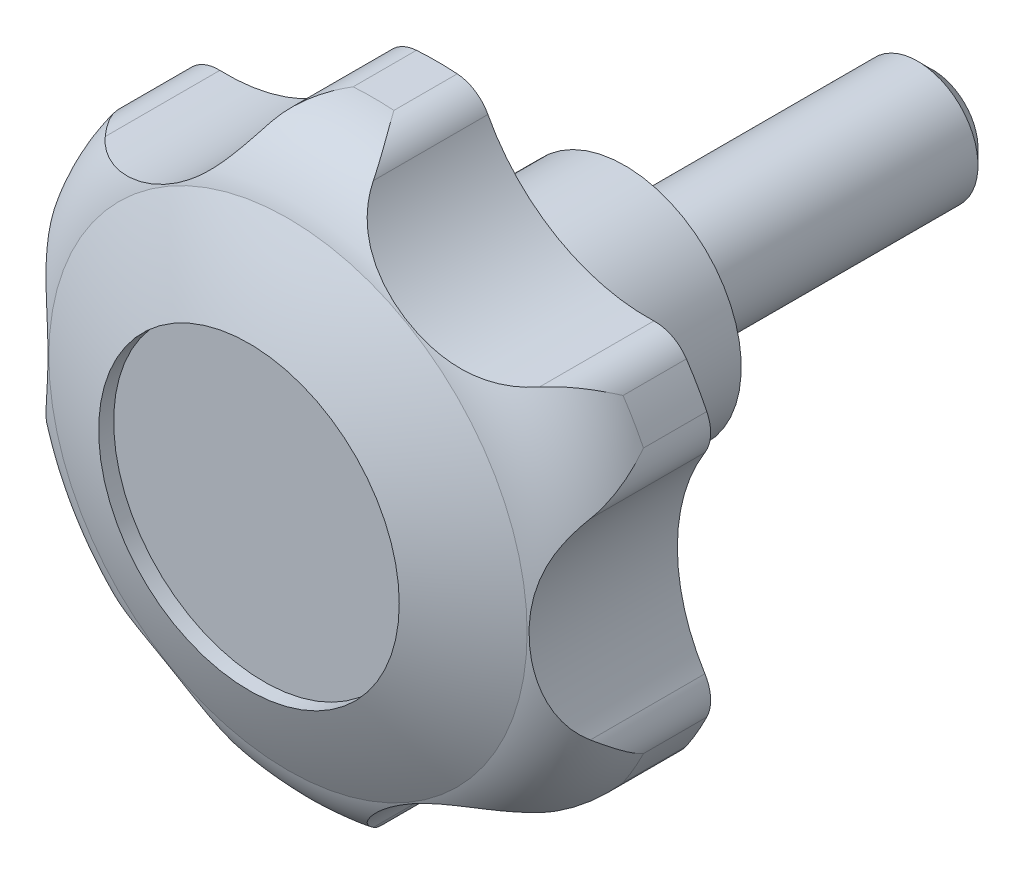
ISO-10303-21;
HEADER;
FILE_DESCRIPTION(('STEP AP214'),'2;1');
FILE_NAME('part.step','',(''),(''),'','','');
FILE_SCHEMA(('AUTOMOTIVE_DESIGN { 1 0 10303 214 1 1 1 1 }'));
ENDSEC;
DATA;
#1=APPLICATION_CONTEXT('core data for automotive mechanical design processes');
#2=APPLICATION_PROTOCOL_DEFINITION('international standard','automotive_design',2000,#1);
#3=PRODUCT_CONTEXT('',#1,'mechanical');
#4=PRODUCT('Part','Part','',(#3));
#5=PRODUCT_RELATED_PRODUCT_CATEGORY('part','',(#4));
#6=PRODUCT_DEFINITION_FORMATION('','',#4);
#7=PRODUCT_DEFINITION_CONTEXT('part definition',#1,'design');
#8=PRODUCT_DEFINITION('design','',#6,#7);
#9=PRODUCT_DEFINITION_SHAPE('','',#8);
#10=(LENGTH_UNIT() NAMED_UNIT(*) SI_UNIT(.MILLI.,.METRE.));
#11=(NAMED_UNIT(*) PLANE_ANGLE_UNIT() SI_UNIT($,.RADIAN.));
#12=(NAMED_UNIT(*) SI_UNIT($,.STERADIAN.) SOLID_ANGLE_UNIT());
#13=UNCERTAINTY_MEASURE_WITH_UNIT(LENGTH_MEASURE(1.E-05),#10,'distance_accuracy_value','');
#14=(GEOMETRIC_REPRESENTATION_CONTEXT(3) GLOBAL_UNCERTAINTY_ASSIGNED_CONTEXT((#13)) GLOBAL_UNIT_ASSIGNED_CONTEXT((#10,
#11,#12)) REPRESENTATION_CONTEXT('',''));
#15=CARTESIAN_POINT('',(0.,0.,0.));
#16=DIRECTION('',(0.,0.,1.));
#17=DIRECTION('',(1.,0.,0.));
#18=AXIS2_PLACEMENT_3D('',#15,#16,#17);
#19=CARTESIAN_POINT('',(0.,0.,57.549053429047));
#20=DIRECTION('',(0.,0.,1.));
#21=DIRECTION('',(-1.,0.,0.));
#22=AXIS2_PLACEMENT_3D('',#19,#20,#21);
#23=CYLINDRICAL_SURFACE('',#22,40.);
#24=CARTESIAN_POINT('',(0.,0.,26.));
#25=DIRECTION('',(0.,0.,1.));
#26=DIRECTION('',(-1.,0.,0.));
#27=AXIS2_PLACEMENT_3D('',#24,#25,#26);
#28=CIRCLE('',#27,40.);
#29=CARTESIAN_POINT('',(33.2039586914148,-22.3046436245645,26.));
#30=VERTEX_POINT('',#29);
#31=CARTESIAN_POINT('',(35.9183673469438,-17.6031499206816,26.));
#32=VERTEX_POINT('',#31);
#33=EDGE_CURVE('E459',#30,#32,#28,.T.);
#34=ORIENTED_EDGE('',*,*,#33,.T.);
#35=DIRECTION('',(0.,0.,1.));
#36=VECTOR('',#35,1.);
#37=CARTESIAN_POINT('',(35.9183673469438,-17.6031499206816,-39.));
#38=LINE('',#37,#36);
#39=CARTESIAN_POINT('',(35.9183673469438,-17.6031499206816,34.4266144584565));
#40=VERTEX_POINT('',#39);
#41=EDGE_CURVE('E182',#32,#40,#38,.T.);
#42=ORIENTED_EDGE('',*,*,#41,.T.);
#43=CARTESIAN_POINT('',(0.,0.,34.4266144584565));
#44=DIRECTION('',(0.,0.,1.));
#45=DIRECTION('',(-1.,0.,0.));
#46=AXIS2_PLACEMENT_3D('',#43,#44,#45);
#47=CIRCLE('',#46,40.);
#48=CARTESIAN_POINT('',(33.2039586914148,-22.3046436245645,34.4266144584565));
#49=VERTEX_POINT('',#48);
#50=EDGE_CURVE('E198',#49,#40,#47,.T.);
#51=ORIENTED_EDGE('',*,*,#50,.F.);
#52=DIRECTION('',(0.,0.,1.));
#53=VECTOR('',#52,1.);
#54=CARTESIAN_POINT('',(33.2039586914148,-22.3046436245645,-39.));
#55=LINE('',#54,#53);
#56=EDGE_CURVE('E597',#30,#49,#55,.T.);
#57=ORIENTED_EDGE('',*,*,#56,.F.);
#58=EDGE_LOOP('',(#34,#42,#51,#57));
#59=FACE_BOUND('',#58,.T.);
#60=ADVANCED_FACE('F14',(#59),#23,.T.);
#61=CARTESIAN_POINT('',(-2.71440865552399,-39.9077935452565,26.));
#62=VERTEX_POINT('',#61);
#63=CARTESIAN_POINT('',(2.71440865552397,-39.9077935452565,26.));
#64=VERTEX_POINT('',#63);
#65=EDGE_CURVE('E462',#62,#64,#28,.T.);
#66=ORIENTED_EDGE('',*,*,#65,.T.);
#67=DIRECTION('',(0.,0.,1.));
#68=VECTOR('',#67,1.);
#69=CARTESIAN_POINT('',(2.71440865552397,-39.9077935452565,-39.));
#70=LINE('',#69,#68);
#71=CARTESIAN_POINT('',(2.71440865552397,-39.9077935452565,34.4266144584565));
#72=VERTEX_POINT('',#71);
#73=EDGE_CURVE('E589',#64,#72,#70,.T.);
#74=ORIENTED_EDGE('',*,*,#73,.T.);
#75=CARTESIAN_POINT('',(-2.71440865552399,-39.9077935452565,34.4266144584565));
#76=VERTEX_POINT('',#75);
#77=EDGE_CURVE('E476',#76,#72,#47,.T.);
#78=ORIENTED_EDGE('',*,*,#77,.F.);
#79=DIRECTION('',(0.,0.,1.));
#80=VECTOR('',#79,1.);
#81=CARTESIAN_POINT('',(-2.71440865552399,-39.9077935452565,-39.));
#82=LINE('',#81,#80);
#83=EDGE_CURVE('E587',#62,#76,#82,.T.);
#84=ORIENTED_EDGE('',*,*,#83,.F.);
#85=EDGE_LOOP('',(#66,#74,#78,#84));
#86=FACE_BOUND('',#85,.T.);
#87=ADVANCED_FACE('F425',(#86),#23,.T.);
#88=CARTESIAN_POINT('',(-35.9183673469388,-17.603149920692,26.));
#89=VERTEX_POINT('',#88);
#90=CARTESIAN_POINT('',(-33.2039586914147,-22.3046436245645,26.));
#91=VERTEX_POINT('',#90);
#92=EDGE_CURVE('E465',#89,#91,#28,.T.);
#93=ORIENTED_EDGE('',*,*,#92,.T.);
#94=DIRECTION('',(0.,0.,1.));
#95=VECTOR('',#94,1.);
#96=CARTESIAN_POINT('',(-33.2039586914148,-22.3046436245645,-39.));
#97=LINE('',#96,#95);
#98=CARTESIAN_POINT('',(-33.2039586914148,-22.3046436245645,34.4266144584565));
#99=VERTEX_POINT('',#98);
#100=EDGE_CURVE('E578',#91,#99,#97,.T.);
#101=ORIENTED_EDGE('',*,*,#100,.T.);
#102=CARTESIAN_POINT('',(-35.9183673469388,-17.603149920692,34.4266144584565));
#103=VERTEX_POINT('',#102);
#104=EDGE_CURVE('E472',#103,#99,#47,.T.);
#105=ORIENTED_EDGE('',*,*,#104,.F.);
#106=DIRECTION('',(0.,0.,1.));
#107=VECTOR('',#106,1.);
#108=CARTESIAN_POINT('',(-35.9183673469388,-17.603149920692,-39.));
#109=LINE('',#108,#107);
#110=EDGE_CURVE('E572',#89,#103,#109,.T.);
#111=ORIENTED_EDGE('',*,*,#110,.F.);
#112=EDGE_LOOP('',(#93,#101,#105,#111));
#113=FACE_BOUND('',#112,.T.);
#114=ADVANCED_FACE('F433',(#113),#23,.T.);
#115=CARTESIAN_POINT('',(-33.2039586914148,22.3046436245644,26.));
#116=VERTEX_POINT('',#115);
#117=CARTESIAN_POINT('',(-35.9183673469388,17.603149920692,26.));
#118=VERTEX_POINT('',#117);
#119=EDGE_CURVE('E464',#116,#118,#28,.T.);
#120=ORIENTED_EDGE('',*,*,#119,.T.);
#121=DIRECTION('',(0.,0.,1.));
#122=VECTOR('',#121,1.);
#123=CARTESIAN_POINT('',(-35.9183673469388,17.603149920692,-39.));
#124=LINE('',#123,#122);
#125=CARTESIAN_POINT('',(-35.9183673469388,17.603149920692,34.4266144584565));
#126=VERTEX_POINT('',#125);
#127=EDGE_CURVE('E37',#118,#126,#124,.T.);
#128=ORIENTED_EDGE('',*,*,#127,.T.);
#129=CARTESIAN_POINT('',(-33.2039586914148,22.3046436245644,34.4266144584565));
#130=VERTEX_POINT('',#129);
#131=EDGE_CURVE('E469',#130,#126,#47,.T.);
#132=ORIENTED_EDGE('',*,*,#131,.F.);
#133=DIRECTION('',(0.,0.,1.));
#134=VECTOR('',#133,1.);
#135=CARTESIAN_POINT('',(-33.2039586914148,22.3046436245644,-39.));
#136=LINE('',#135,#134);
#137=EDGE_CURVE('E559',#116,#130,#136,.T.);
#138=ORIENTED_EDGE('',*,*,#137,.F.);
#139=EDGE_LOOP('',(#120,#128,#132,#138));
#140=FACE_BOUND('',#139,.T.);
#141=ADVANCED_FACE('F446',(#140),#23,.T.);
#142=CARTESIAN_POINT('',(2.71440865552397,39.9077935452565,26.));
#143=VERTEX_POINT('',#142);
#144=CARTESIAN_POINT('',(-2.714408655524,39.9077935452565,26.));
#145=VERTEX_POINT('',#144);
#146=EDGE_CURVE('E460',#143,#145,#28,.T.);
#147=ORIENTED_EDGE('',*,*,#146,.T.);
#148=DIRECTION('',(0.,0.,1.));
#149=VECTOR('',#148,1.);
#150=CARTESIAN_POINT('',(-2.714408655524,39.9077935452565,-39.));
#151=LINE('',#150,#149);
#152=CARTESIAN_POINT('',(-2.714408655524,39.9077935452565,34.4266144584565));
#153=VERTEX_POINT('',#152);
#154=EDGE_CURVE('E613',#145,#153,#151,.T.);
#155=ORIENTED_EDGE('',*,*,#154,.T.);
#156=CARTESIAN_POINT('',(2.71440865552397,39.9077935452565,34.4266144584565));
#157=VERTEX_POINT('',#156);
#158=EDGE_CURVE('E624',#157,#153,#47,.T.);
#159=ORIENTED_EDGE('',*,*,#158,.F.);
#160=DIRECTION('',(0.,0.,1.));
#161=VECTOR('',#160,1.);
#162=CARTESIAN_POINT('',(2.71440865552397,39.9077935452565,-39.));
#163=LINE('',#162,#161);
#164=EDGE_CURVE('E611',#143,#157,#163,.T.);
#165=ORIENTED_EDGE('',*,*,#164,.F.);
#166=EDGE_LOOP('',(#147,#155,#159,#165));
#167=FACE_BOUND('',#166,.T.);
#168=ADVANCED_FACE('F438',(#167),#23,.T.);
#169=CARTESIAN_POINT('',(35.9183673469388,17.6031499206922,26.));
#170=VERTEX_POINT('',#169);
#171=CARTESIAN_POINT('',(33.2039586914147,22.3046436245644,26.));
#172=VERTEX_POINT('',#171);
#173=EDGE_CURVE('E452',#170,#172,#28,.T.);
#174=ORIENTED_EDGE('',*,*,#173,.T.);
#175=DIRECTION('',(0.,0.,1.));
#176=VECTOR('',#175,1.);
#177=CARTESIAN_POINT('',(33.2039586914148,22.3046436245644,-39.));
#178=LINE('',#177,#176);
#179=CARTESIAN_POINT('',(33.2039586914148,22.3046436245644,34.4266144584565));
#180=VERTEX_POINT('',#179);
#181=EDGE_CURVE('E454',#172,#180,#178,.T.);
#182=ORIENTED_EDGE('',*,*,#181,.T.);
#183=CARTESIAN_POINT('',(35.9183673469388,17.6031499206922,34.4266144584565));
#184=VERTEX_POINT('',#183);
#185=EDGE_CURVE('E626',#184,#180,#47,.T.);
#186=ORIENTED_EDGE('',*,*,#185,.F.);
#187=DIRECTION('',(0.,0.,1.));
#188=VECTOR('',#187,1.);
#189=CARTESIAN_POINT('',(35.9183673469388,17.6031499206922,-39.));
#190=LINE('',#189,#188);
#191=EDGE_CURVE('E456',#170,#184,#190,.T.);
#192=ORIENTED_EDGE('',*,*,#191,.F.);
#193=EDGE_LOOP('',(#174,#182,#186,#192));
#194=FACE_BOUND('',#193,.T.);
#195=ADVANCED_FACE('F427',(#194),#23,.T.);
#196=CARTESIAN_POINT('',(0.,0.,-42.9475778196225));
#197=DIRECTION('',(0.,0.,1.));
#198=DIRECTION('',(-1.,0.,0.));
#199=AXIS2_PLACEMENT_3D('',#196,#197,#198);
#200=DEGENERATE_TOROIDAL_SURFACE('',#199,14.2615326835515,100.,.F.);
#201=CARTESIAN_POINT('',(0.,0.,45.802970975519));
#202=DIRECTION('',(0.,0.,1.));
#203=DIRECTION('',(-1.,0.,0.));
#204=AXIS2_PLACEMENT_3D('',#201,#202,#203);
#205=CIRCLE('',#204,31.8181818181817);
#206=CARTESIAN_POINT('',(-31.8181818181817,0.,45.802970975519));
#207=VERTEX_POINT('',#206);
#208=EDGE_CURVE('E475',#207,#207,#205,.T.);
#209=ORIENTED_EDGE('',*,*,#208,.T.);
#210=EDGE_LOOP('',(#209));
#211=FACE_BOUND('',#210,.T.);
#212=CARTESIAN_POINT('',(0.,0.,51.));
#213=DIRECTION('',(0.,0.,-1.));
#214=DIRECTION('',(1.,0.,0.));
#215=AXIS2_PLACEMENT_3D('',#212,#213,#214);
#216=CIRCLE('',#215,20.);
#217=CARTESIAN_POINT('',(20.,0.,51.));
#218=VERTEX_POINT('',#217);
#219=EDGE_CURVE('E917',#218,#218,#216,.T.);
#220=ORIENTED_EDGE('',*,*,#219,.T.);
#221=EDGE_LOOP('',(#220));
#222=FACE_BOUND('',#221,.T.);
#223=ADVANCED_FACE('F437',(#211,#222),#200,.F.);
#224=CARTESIAN_POINT('',(0.,0.,34.4266144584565));
#225=DIRECTION('',(0.,0.,1.));
#226=DIRECTION('',(-1.,0.,0.));
#227=AXIS2_PLACEMENT_3D('',#224,#225,#226);
#228=TOROIDAL_SURFACE('',#227,28.,12.);
#229=CARTESIAN_POINT('',(33.2039586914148,-22.3046436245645,34.4266144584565));
#230=CARTESIAN_POINT('',(33.2016458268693,-22.308086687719,34.4326251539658));
#231=CARTESIAN_POINT('',(33.1993286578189,-22.3115269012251,34.438635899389));
#232=CARTESIAN_POINT('',(33.0621842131,-22.5145941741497,34.7937330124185));
#233=CARTESIAN_POINT('',(32.9128604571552,-22.7045847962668,35.1429751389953));
#234=CARTESIAN_POINT('',(32.5872275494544,-23.0621275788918,35.8404350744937));
#235=CARTESIAN_POINT('',(32.4109089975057,-23.2296718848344,36.1886524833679));
#236=CARTESIAN_POINT('',(32.0328927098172,-23.5393466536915,36.8834426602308));
#237=CARTESIAN_POINT('',(31.8311572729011,-23.6814385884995,37.2300121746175));
#238=CARTESIAN_POINT('',(31.4045582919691,-23.9362981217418,37.9195615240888));
#239=CARTESIAN_POINT('',(31.1797053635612,-24.0490790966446,38.262542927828));
#240=CARTESIAN_POINT('',(30.7879651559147,-24.2091174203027,38.829290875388));
#241=CARTESIAN_POINT('',(30.6268988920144,-24.2656677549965,39.0544968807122));
#242=CARTESIAN_POINT('',(30.2963113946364,-24.3626945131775,39.5020566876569));
#243=CARTESIAN_POINT('',(30.1267933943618,-24.4031770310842,39.7244115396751));
#244=CARTESIAN_POINT('',(29.7801340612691,-24.4666154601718,40.165669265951));
#245=CARTESIAN_POINT('',(29.6029933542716,-24.4895728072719,40.3845724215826));
#246=CARTESIAN_POINT('',(29.2420201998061,-24.5162777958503,40.8183106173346));
#247=CARTESIAN_POINT('',(29.0581817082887,-24.5200076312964,41.0331417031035));
#248=CARTESIAN_POINT('',(28.871632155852,-24.513255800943,41.2454155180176));
#249=B_SPLINE_CURVE_WITH_KNOTS('',3,(#229,#230,#231,#232,#233,#234,#235,#236,#237,#238,#239,
#240,#241,#242,#243,#244,#245,#246,#247,#248),.UNSPECIFIED.,.F.,.F.,(4,2,2,2,2,2,2,2,2,4),(0.,
0.0219089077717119,1.29430371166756,2.56714260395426,3.84189224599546,5.1160591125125,
5.96330602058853,6.81023126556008,7.65708711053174,8.50472706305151),.UNSPECIFIED.);
#250=CARTESIAN_POINT('',(28.8718321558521,-24.513263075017,41.2451879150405));
#251=VERTEX_POINT('',#250);
#252=EDGE_CURVE('E200',#49,#251,#249,.T.);
#253=ORIENTED_EDGE('',*,*,#252,.F.);
#254=ORIENTED_EDGE('',*,*,#50,.T.);
#255=CARTESIAN_POINT('',(35.6648992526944,-12.7469085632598,41.2454563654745));
#256=CARTESIAN_POINT('',(35.7234532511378,-12.8403174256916,41.1200827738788));
#257=CARTESIAN_POINT('',(35.7783600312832,-12.9347527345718,40.9938151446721));
#258=CARTESIAN_POINT('',(35.8810719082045,-13.1252663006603,40.7396819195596));
#259=CARTESIAN_POINT('',(35.9288784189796,-13.2213442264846,40.6118166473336));
#260=CARTESIAN_POINT('',(36.0618532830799,-13.5112308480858,40.226370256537));
#261=CARTESIAN_POINT('',(36.1367290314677,-13.7069387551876,39.9666097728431));
#262=CARTESIAN_POINT('',(36.2603267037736,-14.10023033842,39.4430931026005));
#263=CARTESIAN_POINT('',(36.3090884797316,-14.2978106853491,39.1793436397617));
#264=CARTESIAN_POINT('',(36.3820057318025,-14.6929287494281,38.648326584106));
#265=CARTESIAN_POINT('',(36.4061527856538,-14.8904664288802,38.3810578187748));
#266=CARTESIAN_POINT('',(36.4325564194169,-15.307655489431,37.8107809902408));
#267=CARTESIAN_POINT('',(36.4317470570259,-15.5270305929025,37.5074292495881));
#268=CARTESIAN_POINT('',(36.4021049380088,-15.9605923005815,36.8983745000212));
#269=CARTESIAN_POINT('',(36.3732684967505,-16.1747782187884,36.5926711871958));
#270=CARTESIAN_POINT('',(36.2889979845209,-16.5953080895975,35.9802446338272));
#271=CARTESIAN_POINT('',(36.2336026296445,-16.8016629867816,35.6735235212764));
#272=CARTESIAN_POINT('',(36.0974410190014,-17.2046623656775,35.0593819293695));
#273=CARTESIAN_POINT('',(36.0166818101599,-17.4013095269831,34.7519616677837));
#274=CARTESIAN_POINT('',(35.92201342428,-17.5956985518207,34.4386359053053));
#275=CARTESIAN_POINT('',(35.9201926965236,-17.5994253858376,34.4326251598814));
#276=CARTESIAN_POINT('',(35.9183673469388,-17.603149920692,34.4266144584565));
#277=B_SPLINE_CURVE_WITH_KNOTS('',3,(#255,#256,#257,#258,#259,#260,#261,#262,#263,#264,#265,
#266,#267,#268,#269,#270,#271,#272,#273,#274,#275,#276),.UNSPECIFIED.,.F.,.F.,(4,2,2,2,2,2,2,2,
2,2,4),(0.,0.500746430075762,1.00139300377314,2.00137641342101,2.9998293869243,3.99862388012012,
5.12056047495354,6.24264458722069,7.36309793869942,8.48324026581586,8.50514917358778),.UNSPECIFIED.);
#278=CARTESIAN_POINT('',(35.6650246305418,-12.7471085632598,41.2451879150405));
#279=VERTEX_POINT('',#278);
#280=EDGE_CURVE('E186',#279,#40,#277,.T.);
#281=ORIENTED_EDGE('',*,*,#280,.F.);
#282=CARTESIAN_POINT('',(35.6651500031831,-12.7473085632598,41.24491945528));
#283=CARTESIAN_POINT('',(35.6085788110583,-12.6570647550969,41.3660626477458));
#284=CARTESIAN_POINT('',(35.5511259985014,-12.5640789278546,41.4847174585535));
#285=CARTESIAN_POINT('',(35.4348010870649,-12.3727577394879,41.7168939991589));
#286=CARTESIAN_POINT('',(35.3759290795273,-12.2744227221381,41.8304160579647));
#287=CARTESIAN_POINT('',(35.1978187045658,-11.9717980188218,42.1628295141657));
#288=CARTESIAN_POINT('',(35.0769610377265,-11.7596911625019,42.3738332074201));
#289=CARTESIAN_POINT('',(34.8351019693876,-11.3185575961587,42.7717378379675));
#290=CARTESIAN_POINT('',(34.7141137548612,-11.0897185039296,42.958856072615));
#291=CARTESIAN_POINT('',(34.4734853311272,-10.6150811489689,43.3112197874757));
#292=CARTESIAN_POINT('',(34.353845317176,-10.3692804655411,43.4764621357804));
#293=CARTESIAN_POINT('',(34.118747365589,-9.86348535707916,43.7849552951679));
#294=CARTESIAN_POINT('',(34.0032787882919,-9.60353201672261,43.9282655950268));
#295=CARTESIAN_POINT('',(33.7783302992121,-9.07088645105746,44.1943299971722));
#296=CARTESIAN_POINT('',(33.6688502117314,-8.79819459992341,44.3170847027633));
#297=CARTESIAN_POINT('',(33.4574270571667,-8.2414359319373,44.5436184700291));
#298=CARTESIAN_POINT('',(33.3555017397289,-7.95734460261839,44.6473536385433));
#299=CARTESIAN_POINT('',(33.1608918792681,-7.38024160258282,44.8371251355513));
#300=CARTESIAN_POINT('',(33.0682085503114,-7.08722876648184,44.9231591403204));
#301=CARTESIAN_POINT('',(32.8468004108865,-6.33664057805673,45.1206955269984));
#302=CARTESIAN_POINT('',(32.7250175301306,-5.87417592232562,45.2215195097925));
#303=CARTESIAN_POINT('',(32.5084193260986,-4.93732591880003,45.3921998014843));
#304=CARTESIAN_POINT('',(32.4136174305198,-4.46293476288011,45.4620407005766));
#305=CARTESIAN_POINT('',(32.252391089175,-3.50533052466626,45.5764154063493));
#306=CARTESIAN_POINT('',(32.1860288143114,-3.0221004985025,45.620893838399));
#307=CARTESIAN_POINT('',(32.0828256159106,-2.05113738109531,45.688509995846));
#308=CARTESIAN_POINT('',(32.0459807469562,-1.5634049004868,45.7116505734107));
#309=CARTESIAN_POINT('',(32.0014874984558,-0.570823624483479,45.7394734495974));
#310=CARTESIAN_POINT('',(31.9947863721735,-0.0659157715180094,45.7435570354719));
#311=CARTESIAN_POINT('',(32.0132306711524,0.943168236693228,45.7321242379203));
#312=CARTESIAN_POINT('',(32.0383802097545,1.44734428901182,45.7166053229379));
#313=CARTESIAN_POINT('',(32.1202170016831,2.45139648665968,45.6642103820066));
#314=CARTESIAN_POINT('',(32.1768642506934,2.95127727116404,45.6273614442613));
#315=CARTESIAN_POINT('',(32.3209795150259,3.94402208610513,45.5284482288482));
#316=CARTESIAN_POINT('',(32.4084384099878,4.43688814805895,45.4663914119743));
#317=CARTESIAN_POINT('',(32.5883264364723,5.29501706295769,45.3299527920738));
#318=CARTESIAN_POINT('',(32.6745687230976,5.66261664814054,45.2620642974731));
#319=CARTESIAN_POINT('',(32.8630501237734,6.3892353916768,45.1054461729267));
#320=CARTESIAN_POINT('',(32.9652885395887,6.74825492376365,45.0167174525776));
#321=CARTESIAN_POINT('',(33.1840934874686,7.45459097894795,44.8154471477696));
#322=CARTESIAN_POINT('',(33.3006411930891,7.8019221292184,44.7029367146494));
#323=CARTESIAN_POINT('',(33.5459960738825,8.48223685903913,44.4510688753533));
#324=CARTESIAN_POINT('',(33.6748001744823,8.8152240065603,44.3117181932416));
#325=CARTESIAN_POINT('',(33.9165908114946,9.40234329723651,44.0327348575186));
#326=CARTESIAN_POINT('',(34.0279848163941,9.65951147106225,43.8981026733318));
#327=CARTESIAN_POINT('',(34.2549904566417,10.1602198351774,43.6086117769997));
#328=CARTESIAN_POINT('',(34.3706011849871,10.4037629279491,43.4537573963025));
#329=CARTESIAN_POINT('',(34.6036653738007,10.8750119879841,43.1235819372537));
#330=CARTESIAN_POINT('',(34.7211158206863,11.1027410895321,42.9482918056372));
#331=CARTESIAN_POINT('',(34.9555495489,11.5409190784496,42.577186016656));
#332=CARTESIAN_POINT('',(35.0725330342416,11.7513765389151,42.3813806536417));
#333=CARTESIAN_POINT('',(35.2696517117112,12.0946088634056,42.0301589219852));
#334=CARTESIAN_POINT('',(35.3505397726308,12.2320760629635,41.8797200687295));
#335=CARTESIAN_POINT('',(35.509879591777,12.4971557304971,41.569355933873));
#336=CARTESIAN_POINT('',(35.5883327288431,12.6247738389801,41.4094361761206));
#337=CARTESIAN_POINT('',(35.6651500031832,12.74730856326,41.24491945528));
#338=B_SPLINE_CURVE_WITH_KNOTS('',3,(#282,#283,#284,#285,#286,#287,#288,#289,#290,#291,#292,
#293,#294,#295,#296,#297,#298,#299,#300,#301,#302,#303,#304,#305,#306,#307,#308,#309,#310,#311,
#312,#313,#314,#315,#316,#317,#318,#319,#320,#321,#322,#323,#324,#325,#326,#327,#328,#329,#330,
#331,#332,#333,#334,#335,#336,#337),.UNSPECIFIED.,.F.,.F.,(4,2,2,2,2,2,2,2,2,2,2,2,2,2,2,2,2,2,
2,2,2,2,2,2,2,2,2,4),(0.,0.483826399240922,0.96762174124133,1.93415653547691,2.89115364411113,
3.84828761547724,4.80277758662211,5.75723953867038,6.7138772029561,7.67064037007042,
9.13462899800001,10.5993449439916,12.0672467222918,13.534952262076,15.0484714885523,
16.5621861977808,18.0739827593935,19.5853321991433,20.7353651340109,21.8853478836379,
23.0338335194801,24.1820318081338,25.1138844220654,26.0455377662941,26.9757981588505,
27.905593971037,28.5629371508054,29.2199010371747),.UNSPECIFIED.);
#339=CARTESIAN_POINT('',(35.6650246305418,12.74710856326,41.24518791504));
#340=VERTEX_POINT('',#339);
#341=EDGE_CURVE('E174',#279,#340,#338,.T.);
#342=ORIENTED_EDGE('',*,*,#341,.T.);
#343=CARTESIAN_POINT('',(35.9183673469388,17.603149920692,34.4266144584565));
#344=CARTESIAN_POINT('',(35.9201926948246,17.599425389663,34.4326251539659));
#345=CARTESIAN_POINT('',(35.92201342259,17.5956985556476,34.4386358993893));
#346=CARTESIAN_POINT('',(36.0293026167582,17.3753943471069,34.7937330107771));
#347=CARTESIAN_POINT('',(36.119177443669,17.1510808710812,35.1429751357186));
#348=CARTESIAN_POINT('',(36.2660021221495,16.6903031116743,35.8404350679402));
#349=CARTESIAN_POINT('',(36.3229404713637,16.4538346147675,36.1886524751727));
#350=CARTESIAN_POINT('',(36.4021185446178,15.9716255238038,36.8834426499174));
#351=CARTESIAN_POINT('',(36.4243060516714,15.7258715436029,37.2300121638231));
#352=CARTESIAN_POINT('',(36.4317213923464,15.2289962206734,37.9195615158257));
#353=CARTESIAN_POINT('',(36.4169661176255,14.977877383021,38.2625429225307));
#354=CARTESIAN_POINT('',(36.3596929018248,14.558598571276,38.8292944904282));
#355=CARTESIAN_POINT('',(36.3281331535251,14.390833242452,39.0545040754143));
#356=CARTESIAN_POINT('',(36.2468651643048,14.0560173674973,39.5020709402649));
#357=CARTESIAN_POINT('',(36.1971638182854,13.888966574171,39.7244292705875));
#358=CARTESIAN_POINT('',(36.0787703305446,13.5570263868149,40.165693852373));
#359=CARTESIAN_POINT('',(36.0100797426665,13.3921368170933,40.3846003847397));
#360=CARTESIAN_POINT('',(35.852715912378,13.0661675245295,40.8183451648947));
#361=CARTESIAN_POINT('',(35.7640242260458,12.9050914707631,41.0331794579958));
#362=CARTESIAN_POINT('',(35.6648992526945,12.74690856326,41.2454563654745));
#363=B_SPLINE_CURVE_WITH_KNOTS('',3,(#343,#344,#345,#346,#347,#348,#349,#350,#351,#352,#353,
#354,#355,#356,#357,#358,#359,#360,#361,#362),.UNSPECIFIED.,.F.,.F.,(4,2,2,2,2,2,2,2,2,4),(0.,
0.0219089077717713,1.29430370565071,2.56714259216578,3.84189223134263,5.11605911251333,
5.96331954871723,6.81025830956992,7.65712778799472,8.50478141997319),.UNSPECIFIED.);
#364=EDGE_CURVE('E181',#184,#340,#363,.T.);
#365=ORIENTED_EDGE('',*,*,#364,.F.);
#366=ORIENTED_EDGE('',*,*,#185,.T.);
#367=CARTESIAN_POINT('',(28.8716321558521,24.5132558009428,41.2454155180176));
#368=CARTESIAN_POINT('',(28.9818038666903,24.5172598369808,41.1200412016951));
#369=CARTESIAN_POINT('',(29.0910408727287,24.5175920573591,40.99377285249));
#370=CARTESIAN_POINT('',(29.3073868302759,24.511284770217,40.7396381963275));
#371=CARTESIAN_POINT('',(29.4144962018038,24.5046466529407,40.6117722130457));
#372=CARTESIAN_POINT('',(29.7320333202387,24.4748605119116,40.2263236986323));
#373=CARTESIAN_POINT('',(29.9389594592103,24.4418492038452,39.966561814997));
#374=CARTESIAN_POINT('',(30.3413590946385,24.3522387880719,39.4430423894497));
#375=CARTESIAN_POINT('',(30.5368496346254,24.2956758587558,39.1792915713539));
#376=CARTESIAN_POINT('',(30.9154904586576,24.1612616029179,38.6482718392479));
#377=CARTESIAN_POINT('',(31.0986364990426,24.0834030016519,38.3810017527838));
#378=CARTESIAN_POINT('',(31.473130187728,23.8976729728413,37.8107281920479));
#379=CARTESIAN_POINT('',(31.6627059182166,23.7872849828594,37.5073811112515));
#380=CARTESIAN_POINT('',(32.0233528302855,23.5448350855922,36.8983358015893));
#381=CARTESIAN_POINT('',(32.1944215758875,23.4127703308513,36.5926372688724));
#382=CARTESIAN_POINT('',(32.5164695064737,23.1295282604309,35.9802203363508));
#383=CARTESIAN_POINT('',(32.6674775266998,22.97837900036,35.6735040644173));
#384=CARTESIAN_POINT('',(32.9483992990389,22.6589644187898,35.0593721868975));
#385=CARTESIAN_POINT('',(33.0783188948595,22.4907038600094,34.7519567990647));
#386=CARTESIAN_POINT('',(33.1993286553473,22.3115269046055,34.4386359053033));
#387=CARTESIAN_POINT('',(33.2016458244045,22.308086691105,34.4326251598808));
#388=CARTESIAN_POINT('',(33.2039586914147,22.3046436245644,34.4266144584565));
#389=B_SPLINE_CURVE_WITH_KNOTS('',3,(#367,#368,#369,#370,#371,#372,#373,#374,#375,#376,#377,
#378,#379,#380,#381,#382,#383,#384,#385,#386,#387,#388),.UNSPECIFIED.,.F.,.F.,(4,2,2,2,2,2,2,2,
2,2,4),(0.,0.500748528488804,1.00139720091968,2.00138482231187,2.99984196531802,
3.99864061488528,5.1205594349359,6.24262574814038,7.36306133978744,8.48318592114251,
8.50509482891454),.UNSPECIFIED.);
#390=CARTESIAN_POINT('',(28.8718321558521,24.513263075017,41.2451879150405));
#391=VERTEX_POINT('',#390);
#392=EDGE_CURVE('E249',#391,#180,#389,.T.);
#393=ORIENTED_EDGE('',*,*,#392,.F.);
#394=CARTESIAN_POINT('',(28.8720321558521,24.5132703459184,41.24496030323));
#395=CARTESIAN_POINT('',(28.7655922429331,24.5094002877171,41.3661032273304));
#396=CARTESIAN_POINT('',(28.6563368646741,24.5061377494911,41.4847577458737));
#397=CARTESIAN_POINT('',(28.4324836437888,24.5010583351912,41.7169336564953));
#398=CARTESIAN_POINT('',(28.3178861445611,24.4992413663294,41.830455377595));
#399=CARTESIAN_POINT('',(27.9667476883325,24.4963061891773,42.1628677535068));
#400=CARTESIAN_POINT('',(27.7226272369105,24.4976942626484,42.373870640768));
#401=CARTESIAN_POINT('',(27.2196615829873,24.508805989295,42.7717735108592));
#402=CARTESIAN_POINT('',(26.960985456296,24.5184472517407,42.958890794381));
#403=CARTESIAN_POINT('',(26.429620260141,24.5473768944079,43.3112525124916));
#404=CARTESIAN_POINT('',(26.1569291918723,24.566666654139,43.4764938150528));
#405=CARTESIAN_POINT('',(25.601346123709,24.6159649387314,43.784984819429));
#406=CARTESIAN_POINT('',(25.3184843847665,24.6459437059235,43.9282940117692));
#407=CARTESIAN_POINT('',(24.744723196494,24.717457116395,44.1943561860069));
#408=CARTESIAN_POINT('',(24.4538239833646,24.7589914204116,44.3171097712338));
#409=CARTESIAN_POINT('',(23.8659431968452,24.8542748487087,44.5436413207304));
#410=CARTESIAN_POINT('',(23.5689492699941,24.9080516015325,44.6473753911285));
#411=CARTESIAN_POINT('',(22.9718567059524,25.0280680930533,44.8371447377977));
#412=CARTESIAN_POINT('',(22.6717576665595,25.0943094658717,44.923177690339));
#413=CARTESIAN_POINT('',(21.9110220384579,25.277861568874,45.1207118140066));
#414=CARTESIAN_POINT('',(21.4496222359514,25.4036289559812,45.2215345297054));
#415=CARTESIAN_POINT('',(20.5299830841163,25.6844789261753,45.3922123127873));
#416=CARTESIAN_POINT('',(20.0717454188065,25.8395760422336,45.4620519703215));
#417=CARTESIAN_POINT('',(19.1618190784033,26.1787570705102,45.57642423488));
#418=CARTESIAN_POINT('',(18.710146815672,26.3629032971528,45.6209014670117));
#419=CARTESIAN_POINT('',(17.8176634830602,26.7590137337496,45.6885152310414));
#420=CARTESIAN_POINT('',(17.3768509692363,26.9709742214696,45.7116546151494));
#421=CARTESIAN_POINT('',(16.4950014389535,27.4287384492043,45.7394749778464));
#422=CARTESIAN_POINT('',(16.0543869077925,27.6753920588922,45.7435572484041));
#423=CARTESIAN_POINT('',(15.1897151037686,28.1959134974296,45.7321215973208));
#424=CARTESIAN_POINT('',(14.7656599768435,28.4697848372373,45.7166011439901));
#425=CARTESIAN_POINT('',(13.9370427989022,29.0426900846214,45.6642027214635));
#426=CARTESIAN_POINT('',(13.5324567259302,29.3416916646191,45.6273518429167));
#427=CARTESIAN_POINT('',(12.7447720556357,29.9628780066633,45.528434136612));
#428=CARTESIAN_POINT('',(12.3616671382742,30.2850558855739,45.4663747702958));
#429=CARTESIAN_POINT('',(11.7084538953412,30.8699103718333,45.3299316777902));
#430=CARTESIAN_POINT('',(11.4332282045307,31.1283972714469,45.2620416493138));
#431=CARTESIAN_POINT('',(10.8982060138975,31.6549341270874,45.1054204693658));
#432=CARTESIAN_POINT('',(10.6384088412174,31.922983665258,45.0166902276));
#433=CARTESIAN_POINT('',(10.1361135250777,32.4656393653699,44.8154169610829));
#434=CARTESIAN_POINT('',(9.89359330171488,32.7402365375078,44.7029050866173));
#435=CARTESIAN_POINT('',(9.42710779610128,33.2928737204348,44.4510345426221));
#436=CARTESIAN_POINT('',(9.20313788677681,33.5709128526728,44.3116825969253));
#437=CARTESIAN_POINT('',(8.81557789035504,34.0738665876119,44.0326965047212));
#438=CARTESIAN_POINT('',(8.64856236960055,34.2989200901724,43.8980626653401));
#439=CARTESIAN_POINT('',(8.32844232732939,34.7458654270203,43.6085684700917));
#440=CARTESIAN_POINT('',(8.17533483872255,34.9677579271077,43.4537124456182));
#441=CARTESIAN_POINT('',(7.88375656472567,35.4052199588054,43.1235337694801));
#442=CARTESIAN_POINT('',(7.74526423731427,35.6207984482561,42.9482420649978));
#443=CARTESIAN_POINT('',(7.48301106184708,36.0429105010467,42.5771332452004));
#444=CARTESIAN_POINT('',(7.35924289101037,36.2494485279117,42.3813264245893));
#445=CARTESIAN_POINT('',(7.16056297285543,36.5917616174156,42.0301129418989));
#446=CARTESIAN_POINT('',(7.08196345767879,36.7305353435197,41.8796844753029));
#447=CARTESIAN_POINT('',(6.93207963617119,37.0010465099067,41.5693425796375));
#448=CARTESIAN_POINT('',(6.86079113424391,37.1327879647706,41.4094346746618));
#449=CARTESIAN_POINT('',(6.79308650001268,37.2605716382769,41.2449304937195));
#450=B_SPLINE_CURVE_WITH_KNOTS('',3,(#394,#395,#396,#397,#398,#399,#400,#401,#402,#403,#404,
#405,#406,#407,#408,#409,#410,#411,#412,#413,#414,#415,#416,#417,#418,#419,#420,#421,#422,#423,
#424,#425,#426,#427,#428,#429,#430,#431,#432,#433,#434,#435,#436,#437,#438,#439,#440,#441,#442,
#443,#444,#445,#446,#447,#448,#449),.UNSPECIFIED.,.F.,.F.,(4,2,2,2,2,2,2,2,2,2,2,2,2,2,2,2,2,2,
2,2,2,2,2,2,2,2,2,4),(0.,0.483827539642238,0.967624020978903,1.93416107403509,2.89116033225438,
3.84829645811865,4.80278850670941,5.75725253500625,6.71389231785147,7.67065760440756,
9.134653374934,10.5993764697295,12.067285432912,13.5349981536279,15.0485242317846,
16.562245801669,18.074049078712,19.5854052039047,20.7354290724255,21.8854027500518,
23.0338793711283,24.1820686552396,25.1139194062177,26.0455708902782,26.9758294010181,
27.9056233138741,28.562917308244,29.2198319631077),.UNSPECIFIED.);
#451=CARTESIAN_POINT('',(6.79319247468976,37.2603716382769,41.24518791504));
#452=VERTEX_POINT('',#451);
#453=EDGE_CURVE('E255',#391,#452,#450,.T.);
#454=ORIENTED_EDGE('',*,*,#453,.T.);
#455=CARTESIAN_POINT('',(2.71440865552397,39.9077935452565,34.4266144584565));
#456=CARTESIAN_POINT('',(2.71854686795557,39.9075120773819,34.4326251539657));
#457=CARTESIAN_POINT('',(2.72268476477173,39.9072254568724,34.4386358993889));
#458=CARTESIAN_POINT('',(2.9671184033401,39.889988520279,34.7937330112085));
#459=CARTESIAN_POINT('',(3.20631698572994,39.8556656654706,35.1429751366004));
#460=CARTESIAN_POINT('',(3.67877457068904,39.7524306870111,35.8404350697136));
#461=CARTESIAN_POINT('',(3.91203147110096,39.6835064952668,36.1886524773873));
#462=CARTESIAN_POINT('',(4.36922583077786,39.5109721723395,36.8834426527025));
#463=CARTESIAN_POINT('',(4.59314877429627,39.4073101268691,37.2300121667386));
#464=CARTESIAN_POINT('',(5.02716309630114,39.1652943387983,37.9195615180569));
#465=CARTESIAN_POINT('',(5.23726075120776,39.0269564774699,38.2625429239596));
#466=CARTESIAN_POINT('',(5.57172966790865,38.7677174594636,38.8292935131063));
#467=CARTESIAN_POINT('',(5.70123828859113,38.6565037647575,39.0545021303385));
#468=CARTESIAN_POINT('',(5.95056235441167,38.4187168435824,39.5020670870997));
#469=CARTESIAN_POINT('',(6.07038146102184,38.29214946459,39.7244244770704));
#470=CARTESIAN_POINT('',(6.29865255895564,38.023649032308,40.1656872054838));
#471=CARTESIAN_POINT('',(6.40710547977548,37.8817172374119,40.3845928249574));
#472=CARTESIAN_POINT('',(6.61072071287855,37.5824532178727,40.8183358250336));
#473=CARTESIAN_POINT('',(6.70587062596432,37.4251068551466,41.0331692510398));
#474=CARTESIAN_POINT('',(6.79329844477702,37.2601716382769,41.245445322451));
#475=B_SPLINE_CURVE_WITH_KNOTS('',3,(#455,#456,#457,#458,#459,#460,#461,#462,#463,#464,#465,
#466,#467,#468,#469,#470,#471,#472,#473,#474),.UNSPECIFIED.,.F.,.F.,(4,2,2,2,2,2,2,2,2,4),(0.,
0.0219089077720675,1.29430370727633,2.56714259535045,3.84189223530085,5.11605911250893,
5.96331589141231,6.81025099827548,7.657116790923,8.50476672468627),.UNSPECIFIED.);
#476=EDGE_CURVE('E278',#157,#452,#475,.T.);
#477=ORIENTED_EDGE('',*,*,#476,.F.);
#478=ORIENTED_EDGE('',*,*,#158,.T.);
#479=CARTESIAN_POINT('',(-6.79329844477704,37.2601716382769,41.245445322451));
#480=CARTESIAN_POINT('',(-6.74168077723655,37.3575852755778,41.1200715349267));
#481=CARTESIAN_POINT('',(-6.68735057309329,37.4523535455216,40.9938037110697));
#482=CARTESIAN_POINT('',(-6.57371649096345,37.6365613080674,40.7396700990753));
#483=CARTESIAN_POINT('',(-6.51441360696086,37.7260018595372,40.6118046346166));
#484=CARTESIAN_POINT('',(-6.32985122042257,37.9861045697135,40.2263576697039));
#485=CARTESIAN_POINT('',(-6.19780065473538,38.148802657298,39.9665968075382));
#486=CARTESIAN_POINT('',(-5.91899816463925,38.4524867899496,39.4430793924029));
#487=CARTESIAN_POINT('',(-5.77226904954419,38.5935056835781,39.1793295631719));
#488=CARTESIAN_POINT('',(-5.46654460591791,38.8542124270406,38.648311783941));
#489=CARTESIAN_POINT('',(-5.30754509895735,38.9738929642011,38.3810426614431));
#490=CARTESIAN_POINT('',(-4.95945079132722,39.2053524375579,37.8107667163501));
#491=CARTESIAN_POINT('',(-4.76906235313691,39.3143381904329,37.5074162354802));
#492=CARTESIAN_POINT('',(-4.37876726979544,39.5054467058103,36.8983640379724));
#493=CARTESIAN_POINT('',(-4.17885937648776,39.5875659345,36.5926620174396));
#494=CARTESIAN_POINT('',(-3.77253619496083,39.7248494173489,35.9802380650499));
#495=CARTESIAN_POINT('',(-3.56613078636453,39.7800526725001,35.6735182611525));
#496=CARTESIAN_POINT('',(-3.14904403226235,39.863632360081,35.0593792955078));
#497=CARTESIAN_POINT('',(-2.93836388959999,39.8920162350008,34.7519603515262));
#498=CARTESIAN_POINT('',(-2.72268476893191,39.9072254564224,34.4386359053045));
#499=CARTESIAN_POINT('',(-2.71854687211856,39.9075120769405,34.4326251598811));
#500=CARTESIAN_POINT('',(-2.71440865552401,39.9077935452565,34.4266144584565));
#501=B_SPLINE_CURVE_WITH_KNOTS('',3,(#479,#480,#481,#482,#483,#484,#485,#486,#487,#488,#489,
#490,#491,#492,#493,#494,#495,#496,#497,#498,#499,#500),.UNSPECIFIED.,.F.,.F.,(4,2,2,2,2,2,2,2,
2,2,4),(0.,0.500746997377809,1.00139413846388,2.00137868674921,2.99983278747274,
3.99862840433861,5.12056019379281,6.24263949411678,7.36308804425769,8.4832255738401,
8.50513448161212),.UNSPECIFIED.);
#502=CARTESIAN_POINT('',(-6.79319247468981,37.2603716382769,41.2451879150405));
#503=VERTEX_POINT('',#502);
#504=EDGE_CURVE('E284',#503,#153,#501,.T.);
#505=ORIENTED_EDGE('',*,*,#504,.F.);
#506=CARTESIAN_POINT('',(-6.79308650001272,37.2605716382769,41.2449304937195));
#507=CARTESIAN_POINT('',(-6.84295448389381,37.1664574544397,41.3660736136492));
#508=CARTESIAN_POINT('',(-6.89475631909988,37.0702087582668,41.4847283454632));
#509=CARTESIAN_POINT('',(-7.00228318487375,36.8738074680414,41.7169047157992));
#510=CARTESIAN_POINT('',(-7.05800796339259,36.7736551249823,41.8304266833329));
#511=CARTESIAN_POINT('',(-7.23103394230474,36.4680941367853,42.1628398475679));
#512=CARTESIAN_POINT('',(-7.35429536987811,36.2573745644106,42.3738433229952));
#513=CARTESIAN_POINT('',(-7.61539939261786,35.8273510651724,42.7717474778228));
#514=CARTESIAN_POINT('',(-7.7530860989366,35.6081523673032,42.9588654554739));
#515=CARTESIAN_POINT('',(-8.04382059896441,35.1624428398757,43.3112286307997));
#516=CARTESIAN_POINT('',(-8.19687058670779,34.9359309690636,43.4764706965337));
#517=CARTESIAN_POINT('',(-8.51735374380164,34.4794321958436,43.7849632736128));
#518=CARTESIAN_POINT('',(-8.68474601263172,34.2494566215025,43.9282732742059));
#519=CARTESIAN_POINT('',(-9.03355708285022,33.7883224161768,44.1943370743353));
#520=CARTESIAN_POINT('',(-9.21497547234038,33.5571638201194,44.3170914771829));
#521=CARTESIAN_POINT('',(-9.59143177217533,33.0956864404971,44.5436246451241));
#522=CARTESIAN_POINT('',(-9.78649978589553,32.8653707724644,44.6473595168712));
#523=CARTESIAN_POINT('',(-10.1889814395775,32.4082820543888,44.8371304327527));
#524=CARTESIAN_POINT('',(-10.3963966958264,32.1815094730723,44.9231641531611));
#525=CARTESIAN_POINT('',(-10.9357222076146,31.6144699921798,45.1206999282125));
#526=CARTESIAN_POINT('',(-11.2753377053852,31.2777703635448,45.2215235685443));
#527=CARTESIAN_POINT('',(-11.978376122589,30.6217654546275,45.39220318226));
#528=CARTESIAN_POINT('',(-12.3418107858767,30.3024688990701,45.4620437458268));
#529=CARTESIAN_POINT('',(-13.0905088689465,29.6840405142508,45.5764177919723));
#530=CARTESIAN_POINT('',(-13.4758180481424,29.384954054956,45.6208958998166));
#531=CARTESIAN_POINT('',(-14.2650968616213,28.8100959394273,45.6885114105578));
#532=CARTESIAN_POINT('',(-14.6690639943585,28.5343211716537,45.7116516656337));
#533=CARTESIAN_POINT('',(-15.5064196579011,27.999498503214,45.739473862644));
#534=CARTESIAN_POINT('',(-15.9403329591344,27.7412414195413,45.7435570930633));
#535=CARTESIAN_POINT('',(-16.8234491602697,27.2526731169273,45.7321235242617));
#536=CARTESIAN_POINT('',(-17.2726540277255,27.0223655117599,45.7166041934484));
#537=CARTESIAN_POINT('',(-18.1831087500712,26.5912128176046,45.6642083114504));
#538=CARTESIAN_POINT('',(-18.6443426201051,26.3903307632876,45.6273588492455));
#539=CARTESIAN_POINT('',(-19.5761439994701,26.0187666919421,45.5284444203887));
#540=CARTESIAN_POINT('',(-20.0467087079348,25.848075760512,45.4663869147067));
#541=CARTESIAN_POINT('',(-20.8798141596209,25.5748002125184,45.3299470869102));
#542=CARTESIAN_POINT('',(-21.2412851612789,25.4656891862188,45.2620581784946));
#543=CARTESIAN_POINT('',(-21.9647946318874,25.2656109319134,45.1054392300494));
#544=CARTESIAN_POINT('',(-22.3268330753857,25.1746429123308,45.0167100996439));
#545=CARTESIAN_POINT('',(-23.0479388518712,25.0109668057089,44.8154389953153));
#546=CARTESIAN_POINT('',(-23.4070094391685,24.9382351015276,44.7029281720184));
#547=CARTESIAN_POINT('',(-24.1188549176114,24.8105624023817,44.451059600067));
#548=CARTESIAN_POINT('',(-24.4716313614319,24.7556169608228,44.311708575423));
#549=CARTESIAN_POINT('',(-25.1009857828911,24.6714549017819,44.032724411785));
#550=CARTESIAN_POINT('',(-25.379396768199,24.6393411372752,43.8980916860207));
#551=CARTESIAN_POINT('',(-25.9265253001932,24.5855801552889,43.6085996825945));
#552=CARTESIAN_POINT('',(-26.195244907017,24.5639307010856,43.4537447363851));
#553=CARTESIAN_POINT('',(-26.7198900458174,24.5301461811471,43.123568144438));
#554=CARTESIAN_POINT('',(-26.9758341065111,24.5179969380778,42.9482774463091));
#555=CARTESIAN_POINT('',(-27.4725234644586,24.5019339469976,42.5771705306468));
#556=CARTESIAN_POINT('',(-27.7132762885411,24.498016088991,42.381364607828));
#557=CARTESIAN_POINT('',(-28.109072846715,24.4971100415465,42.0301507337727));
#558=CARTESIAN_POINT('',(-28.2685572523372,24.4984274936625,41.8797208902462));
#559=CARTESIAN_POINT('',(-28.5777746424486,24.5038795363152,41.5693759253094));
#560=CARTESIAN_POINT('',(-28.7275132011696,24.508012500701,41.409466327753));
#561=CARTESIAN_POINT('',(-28.8720321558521,24.5132703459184,41.2449603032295));
#562=B_SPLINE_CURVE_WITH_KNOTS('',3,(#506,#507,#508,#509,#510,#511,#512,#513,#514,#515,#516,
#517,#518,#519,#520,#521,#522,#523,#524,#525,#526,#527,#528,#529,#530,#531,#532,#533,#534,#535,
#536,#537,#538,#539,#540,#541,#542,#543,#544,#545,#546,#547,#548,#549,#550,#551,#552,#553,#554,
#555,#556,#557,#558,#559,#560,#561),.UNSPECIFIED.,.F.,.F.,(4,2,2,2,2,2,2,2,2,2,2,2,2,2,2,2,2,2,
2,2,2,2,2,2,2,2,2,4),(0.,0.483826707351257,0.967622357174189,1.93415776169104,2.89115545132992,
3.84829000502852,4.80278053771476,5.75724305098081,6.71388128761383,7.67064502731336,
9.13463558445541,10.5993534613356,12.067257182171,13.5349646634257,15.0484857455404,
16.5622023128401,18.0740006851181,19.5853519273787,20.7353824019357,21.885362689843,
23.0338458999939,24.182041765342,25.1138944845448,26.0455479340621,26.9758083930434,
27.9056042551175,28.5629077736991,29.2198319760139),.UNSPECIFIED.);
#563=CARTESIAN_POINT('',(-28.8718321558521,24.513263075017,41.24518791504));
#564=VERTEX_POINT('',#563);
#565=EDGE_CURVE('E290',#503,#564,#562,.T.);
#566=ORIENTED_EDGE('',*,*,#565,.T.);
#567=CARTESIAN_POINT('',(-33.2039586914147,22.3046436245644,34.4266144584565));
#568=CARTESIAN_POINT('',(-33.2016458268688,22.3080866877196,34.4326251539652));
#569=CARTESIAN_POINT('',(-33.1993286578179,22.3115269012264,34.4386358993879));
#570=CARTESIAN_POINT('',(-33.0621842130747,22.5145941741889,34.7937330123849));
#571=CARTESIAN_POINT('',(-32.9128604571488,22.7045847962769,35.1429751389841));
#572=CARTESIAN_POINT('',(-32.5872275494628,23.0621275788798,35.8404350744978));
#573=CARTESIAN_POINT('',(-32.4109089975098,23.2296718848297,36.1886524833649));
#574=CARTESIAN_POINT('',(-32.0328927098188,23.539346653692,36.8834426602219));
#575=CARTESIAN_POINT('',(-31.8311572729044,23.681438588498,37.2300121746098));
#576=CARTESIAN_POINT('',(-31.4045582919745,23.9362981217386,37.9195615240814));
#577=CARTESIAN_POINT('',(-31.1797053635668,24.0490790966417,38.2625429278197));
#578=CARTESIAN_POINT('',(-30.7879651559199,24.2091174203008,38.8292908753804));
#579=CARTESIAN_POINT('',(-30.6268988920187,24.2656677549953,39.054496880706));
#580=CARTESIAN_POINT('',(-30.2963113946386,24.3626945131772,39.5020566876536));
#581=CARTESIAN_POINT('',(-30.1267933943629,24.4031770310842,39.7244115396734));
#582=CARTESIAN_POINT('',(-29.780134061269,24.466615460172,40.1656692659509));
#583=CARTESIAN_POINT('',(-29.6029933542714,24.4895728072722,40.3845724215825));
#584=CARTESIAN_POINT('',(-29.2420201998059,24.5162777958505,40.8183106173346));
#585=CARTESIAN_POINT('',(-29.0581817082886,24.5200076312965,41.0331417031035));
#586=CARTESIAN_POINT('',(-28.8716321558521,24.5132558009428,41.2454155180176));
#587=B_SPLINE_CURVE_WITH_KNOTS('',3,(#567,#568,#569,#570,#571,#572,#573,#574,#575,#576,#577,
#578,#579,#580,#581,#582,#583,#584,#585,#586),.UNSPECIFIED.,.F.,.F.,(4,2,2,2,2,2,2,2,2,4),(0.,
0.0219089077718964,1.29430371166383,2.56714260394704,3.84189224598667,5.11605911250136,
5.96330602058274,6.81023126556,7.65708711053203,8.50472706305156),.UNSPECIFIED.);
#588=EDGE_CURVE('E297',#130,#564,#587,.T.);
#589=ORIENTED_EDGE('',*,*,#588,.F.);
#590=ORIENTED_EDGE('',*,*,#131,.T.);
#591=CARTESIAN_POINT('',(-35.6648992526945,12.7469085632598,41.2454563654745));
#592=CARTESIAN_POINT('',(-35.7234532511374,12.8403174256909,41.1200827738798));
#593=CARTESIAN_POINT('',(-35.7783600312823,12.9347527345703,40.9938151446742));
#594=CARTESIAN_POINT('',(-35.8810719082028,13.1252663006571,40.7396819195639));
#595=CARTESIAN_POINT('',(-35.9288784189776,13.2213442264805,40.6118166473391));
#596=CARTESIAN_POINT('',(-36.0618532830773,13.5112308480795,40.2263702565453));
#597=CARTESIAN_POINT('',(-36.1367290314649,13.70693875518,39.9666097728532));
#598=CARTESIAN_POINT('',(-36.2603267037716,14.1002303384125,39.4430931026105));
#599=CARTESIAN_POINT('',(-36.3090884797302,14.2978106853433,39.1793436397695));
#600=CARTESIAN_POINT('',(-36.3820057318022,14.6929287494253,38.6483265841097));
#601=CARTESIAN_POINT('',(-36.406152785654,14.8904664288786,38.3810578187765));
#602=CARTESIAN_POINT('',(-36.4325564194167,15.3076554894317,37.8107809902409));
#603=CARTESIAN_POINT('',(-36.4317470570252,15.5270305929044,37.5074292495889));
#604=CARTESIAN_POINT('',(-36.4021049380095,15.9605923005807,36.8983745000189));
#605=CARTESIAN_POINT('',(-36.3732684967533,16.1747782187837,36.5926711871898));
#606=CARTESIAN_POINT('',(-36.2889979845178,16.5953080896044,35.9802446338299));
#607=CARTESIAN_POINT('',(-36.2336026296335,16.8016629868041,35.6735235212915));
#608=CARTESIAN_POINT('',(-36.097441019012,17.2046623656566,35.0593819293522));
#609=CARTESIAN_POINT('',(-36.0166818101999,17.4013095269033,34.7519616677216));
#610=CARTESIAN_POINT('',(-35.9220134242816,17.5956985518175,34.4386359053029));
#611=CARTESIAN_POINT('',(-35.9201926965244,17.599425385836,34.4326251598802));
#612=CARTESIAN_POINT('',(-35.9183673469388,17.603149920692,34.4266144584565));
#613=B_SPLINE_CURVE_WITH_KNOTS('',3,(#591,#592,#593,#594,#595,#596,#597,#598,#599,#600,#601,
#602,#603,#604,#605,#606,#607,#608,#609,#610,#611,#612),.UNSPECIFIED.,.F.,.F.,(4,2,2,2,2,2,2,2,
2,2,4),(0.,0.500746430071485,1.00139300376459,2.00137641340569,2.99982938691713,
3.99862388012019,5.12056047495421,6.24264458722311,7.36309793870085,8.48324026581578,
8.50514917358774),.UNSPECIFIED.);
#614=CARTESIAN_POINT('',(-35.6650246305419,12.7471085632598,41.24518791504));
#615=VERTEX_POINT('',#614);
#616=EDGE_CURVE('E320',#615,#126,#613,.T.);
#617=ORIENTED_EDGE('',*,*,#616,.F.);
#618=CARTESIAN_POINT('',(-35.6651500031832,12.7473085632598,41.24491945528));
#619=CARTESIAN_POINT('',(-35.6085788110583,12.657064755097,41.3660626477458));
#620=CARTESIAN_POINT('',(-35.5511259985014,12.5640789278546,41.4847174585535));
#621=CARTESIAN_POINT('',(-35.4348010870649,12.372757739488,41.7168939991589));
#622=CARTESIAN_POINT('',(-35.3759290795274,12.2744227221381,41.8304160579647));
#623=CARTESIAN_POINT('',(-35.1978187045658,11.9717980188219,42.1628295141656));
#624=CARTESIAN_POINT('',(-35.0769610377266,11.7596911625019,42.3738332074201));
#625=CARTESIAN_POINT('',(-34.8351019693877,11.3185575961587,42.7717378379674));
#626=CARTESIAN_POINT('',(-34.7141137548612,11.0897185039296,42.9588560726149));
#627=CARTESIAN_POINT('',(-34.4734853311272,10.6150811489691,43.3112197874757));
#628=CARTESIAN_POINT('',(-34.353845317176,10.3692804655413,43.4764621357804));
#629=CARTESIAN_POINT('',(-34.118747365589,9.86348535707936,43.7849552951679));
#630=CARTESIAN_POINT('',(-34.003278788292,9.60353201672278,43.9282655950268));
#631=CARTESIAN_POINT('',(-33.7783302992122,9.0708864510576,44.1943299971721));
#632=CARTESIAN_POINT('',(-33.6688502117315,8.79819459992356,44.3170847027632));
#633=CARTESIAN_POINT('',(-33.4574270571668,8.24143593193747,44.543618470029));
#634=CARTESIAN_POINT('',(-33.355501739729,7.95734460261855,44.6473536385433));
#635=CARTESIAN_POINT('',(-33.1608918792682,7.38024160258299,44.8371251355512));
#636=CARTESIAN_POINT('',(-33.0682085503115,7.08722876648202,44.9231591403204));
#637=CARTESIAN_POINT('',(-32.8468004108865,6.33664057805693,45.1206955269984));
#638=CARTESIAN_POINT('',(-32.7250175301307,5.87417592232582,45.2215195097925));
#639=CARTESIAN_POINT('',(-32.5084193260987,4.93732591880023,45.3921998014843));
#640=CARTESIAN_POINT('',(-32.4136174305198,4.46293476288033,45.4620407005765));
#641=CARTESIAN_POINT('',(-32.2523910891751,3.5053305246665,45.5764154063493));
#642=CARTESIAN_POINT('',(-32.1860288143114,3.02210049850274,45.6208938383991));
#643=CARTESIAN_POINT('',(-32.0828256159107,2.05113738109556,45.6885099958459));
#644=CARTESIAN_POINT('',(-32.0459807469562,1.56340490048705,45.7116505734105));
#645=CARTESIAN_POINT('',(-32.0014874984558,0.570823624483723,45.7394734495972));
#646=CARTESIAN_POINT('',(-31.9947863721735,0.0659157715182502,45.7435570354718));
#647=CARTESIAN_POINT('',(-32.0132306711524,-0.943168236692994,45.7321242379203));
#648=CARTESIAN_POINT('',(-32.0383802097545,-1.44734428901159,45.7166053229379));
#649=CARTESIAN_POINT('',(-32.1202170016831,-2.45139648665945,45.6642103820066));
#650=CARTESIAN_POINT('',(-32.1768642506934,-2.95127727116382,45.6273614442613));
#651=CARTESIAN_POINT('',(-32.3209795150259,-3.9440220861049,45.5284482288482));
#652=CARTESIAN_POINT('',(-32.4084384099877,-4.43688814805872,45.4663914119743));
#653=CARTESIAN_POINT('',(-32.5883264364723,-5.29501706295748,45.3299527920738));
#654=CARTESIAN_POINT('',(-32.6745687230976,-5.66261664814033,45.2620642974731));
#655=CARTESIAN_POINT('',(-32.8630501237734,-6.3892353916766,45.1054461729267));
#656=CARTESIAN_POINT('',(-32.9652885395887,-6.74825492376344,45.0167174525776));
#657=CARTESIAN_POINT('',(-33.1840934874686,-7.45459097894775,44.8154471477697));
#658=CARTESIAN_POINT('',(-33.300641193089,-7.80192212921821,44.7029367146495));
#659=CARTESIAN_POINT('',(-33.5459960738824,-8.48223685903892,44.4510688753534));
#660=CARTESIAN_POINT('',(-33.6748001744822,-8.81522400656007,44.3117181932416));
#661=CARTESIAN_POINT('',(-33.9165908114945,-9.4023432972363,44.0327348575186));
#662=CARTESIAN_POINT('',(-34.027984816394,-9.65951147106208,43.8981026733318));
#663=CARTESIAN_POINT('',(-34.2549904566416,-10.1602198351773,43.6086117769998));
#664=CARTESIAN_POINT('',(-34.370601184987,-10.403762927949,43.4537573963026));
#665=CARTESIAN_POINT('',(-34.6036653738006,-10.875011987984,43.1235819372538));
#666=CARTESIAN_POINT('',(-34.7211158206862,-11.1027410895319,42.9482918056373));
#667=CARTESIAN_POINT('',(-34.9555495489,-11.5409190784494,42.5771860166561));
#668=CARTESIAN_POINT('',(-35.0725330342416,-11.7513765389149,42.3813806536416));
#669=CARTESIAN_POINT('',(-35.2696517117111,-12.0946088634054,42.0301589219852));
#670=CARTESIAN_POINT('',(-35.3505397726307,-12.2320760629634,41.8797200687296));
#671=CARTESIAN_POINT('',(-35.509879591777,-12.497155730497,41.5693559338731));
#672=CARTESIAN_POINT('',(-35.5883327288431,-12.62477383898,41.4094361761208));
#673=CARTESIAN_POINT('',(-35.6651500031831,-12.7473085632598,41.24491945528));
#674=B_SPLINE_CURVE_WITH_KNOTS('',3,(#618,#619,#620,#621,#622,#623,#624,#625,#626,#627,#628,
#629,#630,#631,#632,#633,#634,#635,#636,#637,#638,#639,#640,#641,#642,#643,#644,#645,#646,#647,
#648,#649,#650,#651,#652,#653,#654,#655,#656,#657,#658,#659,#660,#661,#662,#663,#664,#665,#666,
#667,#668,#669,#670,#671,#672,#673),.UNSPECIFIED.,.F.,.F.,(4,2,2,2,2,2,2,2,2,2,2,2,2,2,2,2,2,2,
2,2,2,2,2,2,2,2,2,4),(0.,0.483826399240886,0.967621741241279,1.93415653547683,2.89115364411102,
3.84828761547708,4.80277758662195,5.75723953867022,6.71387720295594,7.67064037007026,
9.13462899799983,10.5993449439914,12.0672467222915,13.5349522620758,15.0484714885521,
16.5621861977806,18.0739827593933,19.5853321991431,20.7353651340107,21.8853478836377,
23.0338335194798,24.1820318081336,25.1138844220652,26.0455377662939,26.9757981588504,
27.9055939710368,28.5629371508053,29.2199010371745),.UNSPECIFIED.);
#675=CARTESIAN_POINT('',(-35.6650246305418,-12.7471085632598,41.24518791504));
#676=VERTEX_POINT('',#675);
#677=EDGE_CURVE('E326',#615,#676,#674,.T.);
#678=ORIENTED_EDGE('',*,*,#677,.T.);
#679=CARTESIAN_POINT('',(-35.9183673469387,-17.603149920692,34.4266144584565));
#680=CARTESIAN_POINT('',(-35.9201926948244,-17.5994253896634,34.4326251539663));
#681=CARTESIAN_POINT('',(-35.9220134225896,-17.5956985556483,34.43863589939));
#682=CARTESIAN_POINT('',(-36.0293026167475,-17.3753943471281,34.7937330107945));
#683=CARTESIAN_POINT('',(-36.1191774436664,-17.1510808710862,35.1429751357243));
#684=CARTESIAN_POINT('',(-36.2660021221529,-16.6903031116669,35.840435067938));
#685=CARTESIAN_POINT('',(-36.3229404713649,-16.453834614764,36.1886524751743));
#686=CARTESIAN_POINT('',(-36.4021185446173,-15.9716255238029,36.8834426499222));
#687=CARTESIAN_POINT('',(-36.4243060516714,-15.7258715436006,37.2300121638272));
#688=CARTESIAN_POINT('',(-36.4317213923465,-15.2289962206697,37.9195615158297));
#689=CARTESIAN_POINT('',(-36.4169661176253,-14.9778773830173,38.2625429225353));
#690=CARTESIAN_POINT('',(-36.3596929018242,-14.5585985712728,38.8292944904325));
#691=CARTESIAN_POINT('',(-36.3281331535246,-14.3908332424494,39.0545040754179));
#692=CARTESIAN_POINT('',(-36.2468651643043,-14.0560173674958,39.5020709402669));
#693=CARTESIAN_POINT('',(-36.1971638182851,-13.8889665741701,39.7244292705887));
#694=CARTESIAN_POINT('',(-36.0787703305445,-13.5570263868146,40.1656938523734));
#695=CARTESIAN_POINT('',(-36.0100797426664,-13.3921368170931,40.3846003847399));
#696=CARTESIAN_POINT('',(-35.852715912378,-13.0661675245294,40.8183451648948));
#697=CARTESIAN_POINT('',(-35.7640242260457,-12.905091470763,41.0331794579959));
#698=CARTESIAN_POINT('',(-35.6648992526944,-12.7469085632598,41.2454563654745));
#699=B_SPLINE_CURVE_WITH_KNOTS('',3,(#679,#680,#681,#682,#683,#684,#685,#686,#687,#688,#689,
#690,#691,#692,#693,#694,#695,#696,#697,#698),.UNSPECIFIED.,.F.,.F.,(4,2,2,2,2,2,2,2,2,4),(0.,
0.0219089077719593,1.29430370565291,2.56714259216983,3.84189223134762,5.11605911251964,
5.96331954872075,6.81025830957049,7.65712778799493,8.50478141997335),.UNSPECIFIED.);
#700=EDGE_CURVE('E333',#103,#676,#699,.T.);
#701=ORIENTED_EDGE('',*,*,#700,.F.);
#702=ORIENTED_EDGE('',*,*,#104,.T.);
#703=CARTESIAN_POINT('',(-28.8716321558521,-24.513255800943,41.2454155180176));
#704=CARTESIAN_POINT('',(-28.9818038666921,-24.5172598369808,41.1200412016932));
#705=CARTESIAN_POINT('',(-29.0910408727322,-24.5175920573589,40.9937728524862));
#706=CARTESIAN_POINT('',(-29.3073868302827,-24.5112847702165,40.7396381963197));
#707=CARTESIAN_POINT('',(-29.4144962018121,-24.50464665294,40.611772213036));
#708=CARTESIAN_POINT('',(-29.732033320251,-24.4748605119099,40.2263236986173));
#709=CARTESIAN_POINT('',(-29.938959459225,-24.4418492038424,39.9665618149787));
#710=CARTESIAN_POINT('',(-30.341359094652,-24.352238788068,39.4430423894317));
#711=CARTESIAN_POINT('',(-30.5368496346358,-24.2956758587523,39.1792915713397));
#712=CARTESIAN_POINT('',(-30.9154904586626,-24.1612616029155,38.6482718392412));
#713=CARTESIAN_POINT('',(-31.0986364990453,-24.08340300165,38.3810017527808));
#714=CARTESIAN_POINT('',(-31.4731301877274,-23.897672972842,37.8107281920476));
#715=CARTESIAN_POINT('',(-31.6627059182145,-23.7872849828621,37.5073811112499));
#716=CARTESIAN_POINT('',(-32.0233528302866,-23.5448350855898,36.8983358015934));
#717=CARTESIAN_POINT('',(-32.194421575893,-23.412770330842,36.5926372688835));
#718=CARTESIAN_POINT('',(-32.5164695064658,-23.1295282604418,35.9802203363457));
#719=CARTESIAN_POINT('',(-32.6674775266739,-22.9783790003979,35.6735040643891));
#720=CARTESIAN_POINT('',(-32.948399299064,-22.6589644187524,35.0593721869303));
#721=CARTESIAN_POINT('',(-33.0783188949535,-22.4907038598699,34.7519567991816));
#722=CARTESIAN_POINT('',(-33.1993286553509,-22.3115269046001,34.4386359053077));
#723=CARTESIAN_POINT('',(-33.2016458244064,-22.3080866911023,34.432625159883));
#724=CARTESIAN_POINT('',(-33.2039586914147,-22.3046436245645,34.4266144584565));
#725=B_SPLINE_CURVE_WITH_KNOTS('',3,(#703,#704,#705,#706,#707,#708,#709,#710,#711,#712,#713,
#714,#715,#716,#717,#718,#719,#720,#721,#722,#723,#724),.UNSPECIFIED.,.F.,.F.,(4,2,2,2,2,2,2,2,
2,2,4),(0.,0.500748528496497,1.00139720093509,2.00138482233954,2.99984196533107,
3.99864061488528,5.12055943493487,6.24262574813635,7.3630613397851,8.4831859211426,
8.50509482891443),.UNSPECIFIED.);
#726=CARTESIAN_POINT('',(-28.8718321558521,-24.513263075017,41.2451879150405));
#727=VERTEX_POINT('',#726);
#728=EDGE_CURVE('E339',#727,#99,#725,.T.);
#729=ORIENTED_EDGE('',*,*,#728,.F.);
#730=CARTESIAN_POINT('',(-28.8720321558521,-24.5132703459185,41.24496030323));
#731=CARTESIAN_POINT('',(-28.7655922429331,-24.5094002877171,41.3661032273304));
#732=CARTESIAN_POINT('',(-28.6563368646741,-24.506137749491,41.4847577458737));
#733=CARTESIAN_POINT('',(-28.4324836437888,-24.5010583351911,41.7169336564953));
#734=CARTESIAN_POINT('',(-28.3178861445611,-24.4992413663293,41.8304553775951));
#735=CARTESIAN_POINT('',(-27.9667476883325,-24.4963061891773,42.1628677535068));
#736=CARTESIAN_POINT('',(-27.7226272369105,-24.4976942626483,42.373870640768));
#737=CARTESIAN_POINT('',(-27.2196615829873,-24.5088059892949,42.7717735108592));
#738=CARTESIAN_POINT('',(-26.960985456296,-24.5184472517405,42.958890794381));
#739=CARTESIAN_POINT('',(-26.4296202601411,-24.5473768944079,43.3112525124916));
#740=CARTESIAN_POINT('',(-26.1569291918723,-24.5666666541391,43.4764938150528));
#741=CARTESIAN_POINT('',(-25.601346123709,-24.6159649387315,43.784984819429));
#742=CARTESIAN_POINT('',(-25.3184843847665,-24.6459437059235,43.9282940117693));
#743=CARTESIAN_POINT('',(-24.744723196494,-24.7174571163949,44.194356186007));
#744=CARTESIAN_POINT('',(-24.4538239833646,-24.7589914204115,44.3171097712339));
#745=CARTESIAN_POINT('',(-23.8659431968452,-24.8542748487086,44.5436413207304));
#746=CARTESIAN_POINT('',(-23.5689492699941,-24.9080516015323,44.6473753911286));
#747=CARTESIAN_POINT('',(-22.9718567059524,-25.0280680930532,44.8371447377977));
#748=CARTESIAN_POINT('',(-22.6717576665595,-25.0943094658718,44.923177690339));
#749=CARTESIAN_POINT('',(-21.9110220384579,-25.2778615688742,45.1207118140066));
#750=CARTESIAN_POINT('',(-21.4496222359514,-25.4036289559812,45.2215345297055));
#751=CARTESIAN_POINT('',(-20.5299830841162,-25.6844789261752,45.3922123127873));
#752=CARTESIAN_POINT('',(-20.0717454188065,-25.8395760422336,45.4620519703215));
#753=CARTESIAN_POINT('',(-19.1618190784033,-26.1787570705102,45.57642423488));
#754=CARTESIAN_POINT('',(-18.710146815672,-26.3629032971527,45.6209014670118));
#755=CARTESIAN_POINT('',(-17.8176634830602,-26.7590137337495,45.6885152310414));
#756=CARTESIAN_POINT('',(-17.3768509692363,-26.9709742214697,45.7116546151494));
#757=CARTESIAN_POINT('',(-16.4950014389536,-27.4287384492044,45.7394749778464));
#758=CARTESIAN_POINT('',(-16.0543869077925,-27.6753920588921,45.7435572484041));
#759=CARTESIAN_POINT('',(-15.1897151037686,-28.1959134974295,45.7321215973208));
#760=CARTESIAN_POINT('',(-14.7656599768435,-28.4697848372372,45.7166011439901));
#761=CARTESIAN_POINT('',(-13.9370427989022,-29.0426900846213,45.6642027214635));
#762=CARTESIAN_POINT('',(-13.5324567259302,-29.341691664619,45.6273518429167));
#763=CARTESIAN_POINT('',(-12.7447720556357,-29.9628780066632,45.528434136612));
#764=CARTESIAN_POINT('',(-12.3616671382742,-30.2850558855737,45.4663747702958));
#765=CARTESIAN_POINT('',(-11.7084538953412,-30.8699103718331,45.3299316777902));
#766=CARTESIAN_POINT('',(-11.4332282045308,-31.1283972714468,45.2620416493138));
#767=CARTESIAN_POINT('',(-10.8982060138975,-31.6549341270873,45.1054204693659));
#768=CARTESIAN_POINT('',(-10.6384088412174,-31.9229836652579,45.0166902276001));
#769=CARTESIAN_POINT('',(-10.1361135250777,-32.4656393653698,44.8154169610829));
#770=CARTESIAN_POINT('',(-9.89359330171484,-32.7402365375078,44.7029050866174));
#771=CARTESIAN_POINT('',(-9.42710779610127,-33.2928737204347,44.4510345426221));
#772=CARTESIAN_POINT('',(-9.20313788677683,-33.5709128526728,44.3116825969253));
#773=CARTESIAN_POINT('',(-8.81557789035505,-34.0738665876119,44.0326965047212));
#774=CARTESIAN_POINT('',(-8.64856236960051,-34.2989200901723,43.8980626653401));
#775=CARTESIAN_POINT('',(-8.32844232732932,-34.7458654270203,43.6085684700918));
#776=CARTESIAN_POINT('',(-8.17533483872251,-34.9677579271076,43.4537124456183));
#777=CARTESIAN_POINT('',(-7.88375656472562,-35.4052199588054,43.1235337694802));
#778=CARTESIAN_POINT('',(-7.74526423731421,-35.6207984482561,42.9482420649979));
#779=CARTESIAN_POINT('',(-7.48301106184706,-36.0429105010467,42.5771332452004));
#780=CARTESIAN_POINT('',(-7.35924289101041,-36.2494485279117,42.3813264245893));
#781=CARTESIAN_POINT('',(-7.16056297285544,-36.5917616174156,42.0301129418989));
#782=CARTESIAN_POINT('',(-7.08196345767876,-36.7305353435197,41.8796844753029));
#783=CARTESIAN_POINT('',(-6.93207963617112,-37.0010465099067,41.5693425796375));
#784=CARTESIAN_POINT('',(-6.86079113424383,-37.1327879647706,41.4094346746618));
#785=CARTESIAN_POINT('',(-6.79308650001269,-37.260571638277,41.2449304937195));
#786=B_SPLINE_CURVE_WITH_KNOTS('',3,(#730,#731,#732,#733,#734,#735,#736,#737,#738,#739,#740,
#741,#742,#743,#744,#745,#746,#747,#748,#749,#750,#751,#752,#753,#754,#755,#756,#757,#758,#759,
#760,#761,#762,#763,#764,#765,#766,#767,#768,#769,#770,#771,#772,#773,#774,#775,#776,#777,#778,
#779,#780,#781,#782,#783,#784,#785),.UNSPECIFIED.,.F.,.F.,(4,2,2,2,2,2,2,2,2,2,2,2,2,2,2,2,2,2,
2,2,2,2,2,2,2,2,2,4),(0.,0.483827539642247,0.967624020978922,1.9341610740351,2.8911603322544,
3.84829645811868,4.80278850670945,5.75725253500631,6.71389231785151,7.67065760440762,
9.13465337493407,10.5993764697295,12.067285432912,13.5349981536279,15.0485242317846,
16.562245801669,18.0740490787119,19.5854052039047,20.7354290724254,21.8854027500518,
23.0338793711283,24.1820686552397,25.1139194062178,26.0455708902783,26.9758294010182,
27.9056233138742,28.5629173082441,29.2198319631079),.UNSPECIFIED.);
#787=CARTESIAN_POINT('',(-6.79319247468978,-37.260371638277,41.2451879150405));
#788=VERTEX_POINT('',#787);
#789=EDGE_CURVE('E363',#727,#788,#786,.T.);
#790=ORIENTED_EDGE('',*,*,#789,.T.);
#791=CARTESIAN_POINT('',(-2.714408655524,-39.9077935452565,34.4266144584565));
#792=CARTESIAN_POINT('',(-2.71854686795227,-39.907512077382,34.432625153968));
#793=CARTESIAN_POINT('',(-2.7226847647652,-39.9072254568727,34.4386358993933));
#794=CARTESIAN_POINT('',(-2.96711840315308,-39.8899885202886,34.7937330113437));
#795=CARTESIAN_POINT('',(-3.2063169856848,-39.8556656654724,35.1429751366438));
#796=CARTESIAN_POINT('',(-3.6787745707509,-39.7524306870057,35.8404350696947));
#797=CARTESIAN_POINT('',(-3.9120314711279,-39.683506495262,36.1886524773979));
#798=CARTESIAN_POINT('',(-4.36922583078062,-39.5109721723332,36.8834426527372));
#799=CARTESIAN_POINT('',(-4.5931487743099,-39.4073101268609,37.2300121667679));
#800=CARTESIAN_POINT('',(-5.02716309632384,-39.1652943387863,37.9195615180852));
#801=CARTESIAN_POINT('',(-5.23726075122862,-39.0269564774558,38.2625429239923));
#802=CARTESIAN_POINT('',(-5.57172966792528,-38.7677174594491,38.8292935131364));
#803=CARTESIAN_POINT('',(-5.70123828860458,-38.6565037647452,39.0545021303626));
#804=CARTESIAN_POINT('',(-5.95056235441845,-38.4187168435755,39.5020670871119));
#805=CARTESIAN_POINT('',(-6.07038146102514,-38.2921494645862,39.7244244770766));
#806=CARTESIAN_POINT('',(-6.29865255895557,-38.023649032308,40.1656872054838));
#807=CARTESIAN_POINT('',(-6.40710547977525,-37.8817172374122,40.3845928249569));
#808=CARTESIAN_POINT('',(-6.61072071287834,-37.5824532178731,40.818335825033));
#809=CARTESIAN_POINT('',(-6.70587062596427,-37.4251068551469,41.0331692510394));
#810=CARTESIAN_POINT('',(-6.79329844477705,-37.260171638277,41.245445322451));
#811=B_SPLINE_CURVE_WITH_KNOTS('',3,(#791,#792,#793,#794,#795,#796,#797,#798,#799,#800,#801,
#802,#803,#804,#805,#806,#807,#808,#809,#810),.UNSPECIFIED.,.F.,.F.,(4,2,2,2,2,2,2,2,2,4),(0.,
0.0219089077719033,1.29430370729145,2.56714259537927,3.84189223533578,5.1160591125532,
5.96331589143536,6.81025099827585,7.65711679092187,8.50476672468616),.UNSPECIFIED.);
#812=EDGE_CURVE('E370',#76,#788,#811,.T.);
#813=ORIENTED_EDGE('',*,*,#812,.F.);
#814=ORIENTED_EDGE('',*,*,#77,.T.);
#815=CARTESIAN_POINT('',(6.79329844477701,-37.260171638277,41.245445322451));
#816=CARTESIAN_POINT('',(6.74168077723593,-37.357585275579,41.1200715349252));
#817=CARTESIAN_POINT('',(6.68735057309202,-37.4523535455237,40.9938037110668));
#818=CARTESIAN_POINT('',(6.57371649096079,-37.6365613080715,40.7396700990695));
#819=CARTESIAN_POINT('',(6.51441360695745,-37.7260018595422,40.6118046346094));
#820=CARTESIAN_POINT('',(6.32985122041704,-37.9861045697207,40.2263576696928));
#821=CARTESIAN_POINT('',(6.19780065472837,-38.1488026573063,39.9665968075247));
#822=CARTESIAN_POINT('',(5.91899816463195,-38.4524867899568,39.4430793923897));
#823=CARTESIAN_POINT('',(5.77226904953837,-38.5935056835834,39.1793295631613));
#824=CARTESIAN_POINT('',(5.46654460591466,-38.8542124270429,38.6483117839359));
#825=CARTESIAN_POINT('',(5.30754509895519,-38.9738929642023,38.3810426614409));
#826=CARTESIAN_POINT('',(4.95945079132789,-39.2053524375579,37.8107667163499));
#827=CARTESIAN_POINT('',(4.76906235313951,-39.3143381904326,37.5074162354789));
#828=CARTESIAN_POINT('',(4.37876726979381,-39.5054467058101,36.8983640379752));
#829=CARTESIAN_POINT('',(4.17885937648,-39.5875659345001,36.5926620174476));
#830=CARTESIAN_POINT('',(3.77253619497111,-39.7248494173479,35.9802380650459));
#831=CARTESIAN_POINT('',(3.5661307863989,-39.7800526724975,35.6735182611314));
#832=CARTESIAN_POINT('',(3.14904403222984,-39.8636323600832,35.0593792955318));
#833=CARTESIAN_POINT('',(2.93836388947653,-39.8920162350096,34.7519603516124));
#834=CARTESIAN_POINT('',(2.72268476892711,-39.9072254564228,34.4386359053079));
#835=CARTESIAN_POINT('',(2.7185468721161,-39.9075120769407,34.4326251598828));
#836=CARTESIAN_POINT('',(2.71440865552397,-39.9077935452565,34.4266144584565));
#837=B_SPLINE_CURVE_WITH_KNOTS('',3,(#815,#816,#817,#818,#819,#820,#821,#822,#823,#824,#825,
#826,#827,#828,#829,#830,#831,#832,#833,#834,#835,#836),.UNSPECIFIED.,.F.,.F.,(4,2,2,2,2,2,2,2,
2,2,4),(0.,0.500746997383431,1.00139413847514,2.00137868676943,2.99983278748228,
3.99862840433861,5.12056019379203,6.24263949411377,7.36308804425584,8.48322557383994,
8.50513448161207),.UNSPECIFIED.);
#838=CARTESIAN_POINT('',(6.79319247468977,-37.260371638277,41.2451879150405));
#839=VERTEX_POINT('',#838);
#840=EDGE_CURVE('E376',#839,#72,#837,.T.);
#841=ORIENTED_EDGE('',*,*,#840,.F.);
#842=CARTESIAN_POINT('',(6.79308650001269,-37.260571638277,41.2449304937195));
#843=CARTESIAN_POINT('',(6.84295448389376,-37.1664574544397,41.3660736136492));
#844=CARTESIAN_POINT('',(6.89475631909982,-37.0702087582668,41.4847283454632));
#845=CARTESIAN_POINT('',(7.00228318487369,-36.8738074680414,41.7169047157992));
#846=CARTESIAN_POINT('',(7.05800796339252,-36.7736551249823,41.8304266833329));
#847=CARTESIAN_POINT('',(7.23103394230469,-36.4680941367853,42.162839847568));
#848=CARTESIAN_POINT('',(7.35429536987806,-36.2573745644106,42.3738433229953));
#849=CARTESIAN_POINT('',(7.61539939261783,-35.8273510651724,42.7717474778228));
#850=CARTESIAN_POINT('',(7.75308609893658,-35.6081523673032,42.958865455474));
#851=CARTESIAN_POINT('',(8.04382059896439,-35.1624428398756,43.3112286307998));
#852=CARTESIAN_POINT('',(8.19687058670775,-34.9359309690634,43.4764706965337));
#853=CARTESIAN_POINT('',(8.51735374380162,-34.4794321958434,43.7849632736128));
#854=CARTESIAN_POINT('',(8.68474601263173,-34.2494566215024,43.928273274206));
#855=CARTESIAN_POINT('',(9.03355708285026,-33.7883224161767,44.1943370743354));
#856=CARTESIAN_POINT('',(9.21497547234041,-33.5571638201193,44.317091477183));
#857=CARTESIAN_POINT('',(9.59143177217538,-33.095686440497,44.5436246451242));
#858=CARTESIAN_POINT('',(9.78649978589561,-32.8653707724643,44.6473595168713));
#859=CARTESIAN_POINT('',(10.1889814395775,-32.4082820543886,44.8371304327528));
#860=CARTESIAN_POINT('',(10.3963966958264,-32.181509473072,44.9231641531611));
#861=CARTESIAN_POINT('',(10.9357222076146,-31.6144699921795,45.1206999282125));
#862=CARTESIAN_POINT('',(11.2753377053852,-31.2777703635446,45.2215235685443));
#863=CARTESIAN_POINT('',(11.9783761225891,-30.6217654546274,45.3922031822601));
#864=CARTESIAN_POINT('',(12.3418107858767,-30.30246889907,45.4620437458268));
#865=CARTESIAN_POINT('',(13.0905088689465,-29.6840405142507,45.5764177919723));
#866=CARTESIAN_POINT('',(13.4758180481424,-29.3849540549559,45.6208958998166));
#867=CARTESIAN_POINT('',(14.2650968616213,-28.8100959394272,45.6885114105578));
#868=CARTESIAN_POINT('',(14.6690639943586,-28.5343211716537,45.7116516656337));
#869=CARTESIAN_POINT('',(15.5064196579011,-27.999498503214,45.739473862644));
#870=CARTESIAN_POINT('',(15.9403329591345,-27.7412414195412,45.7435570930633));
#871=CARTESIAN_POINT('',(16.8234491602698,-27.2526731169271,45.7321235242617));
#872=CARTESIAN_POINT('',(17.2726540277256,-27.0223655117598,45.7166041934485));
#873=CARTESIAN_POINT('',(18.1831087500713,-26.5912128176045,45.6642083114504));
#874=CARTESIAN_POINT('',(18.6443426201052,-26.3903307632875,45.6273588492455));
#875=CARTESIAN_POINT('',(19.5761439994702,-26.0187666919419,45.5284444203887));
#876=CARTESIAN_POINT('',(20.0467087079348,-25.8480757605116,45.4663869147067));
#877=CARTESIAN_POINT('',(20.8798141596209,-25.5748002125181,45.3299470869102));
#878=CARTESIAN_POINT('',(21.241285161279,-25.4656891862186,45.2620581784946));
#879=CARTESIAN_POINT('',(21.9647946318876,-25.2656109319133,45.1054392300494));
#880=CARTESIAN_POINT('',(22.3268330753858,-25.1746429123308,45.0167100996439));
#881=CARTESIAN_POINT('',(23.0479388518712,-25.0109668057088,44.8154389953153));
#882=CARTESIAN_POINT('',(23.4070094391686,-24.9382351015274,44.7029281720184));
#883=CARTESIAN_POINT('',(24.1188549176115,-24.8105624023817,44.451059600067));
#884=CARTESIAN_POINT('',(24.471631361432,-24.7556169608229,44.311708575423));
#885=CARTESIAN_POINT('',(25.1009857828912,-24.671454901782,44.032724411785));
#886=CARTESIAN_POINT('',(25.3793967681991,-24.6393411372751,43.8980916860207));
#887=CARTESIAN_POINT('',(25.9265253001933,-24.5855801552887,43.6085996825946));
#888=CARTESIAN_POINT('',(26.1952449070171,-24.5639307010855,43.4537447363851));
#889=CARTESIAN_POINT('',(26.7198900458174,-24.530146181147,43.123568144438));
#890=CARTESIAN_POINT('',(26.9758341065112,-24.5179969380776,42.9482774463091));
#891=CARTESIAN_POINT('',(27.4725234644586,-24.5019339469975,42.5771705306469));
#892=CARTESIAN_POINT('',(27.7132762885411,-24.498016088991,42.3813646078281));
#893=CARTESIAN_POINT('',(28.109072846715,-24.4971100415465,42.0301507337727));
#894=CARTESIAN_POINT('',(28.2685572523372,-24.4984274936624,41.8797208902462));
#895=CARTESIAN_POINT('',(28.5777746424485,-24.5038795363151,41.5693759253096));
#896=CARTESIAN_POINT('',(28.7275132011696,-24.5080125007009,41.4094663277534));
#897=CARTESIAN_POINT('',(28.8720321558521,-24.5132703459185,41.24496030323));
#898=B_SPLINE_CURVE_WITH_KNOTS('',3,(#842,#843,#844,#845,#846,#847,#848,#849,#850,#851,#852,
#853,#854,#855,#856,#857,#858,#859,#860,#861,#862,#863,#864,#865,#866,#867,#868,#869,#870,#871,
#872,#873,#874,#875,#876,#877,#878,#879,#880,#881,#882,#883,#884,#885,#886,#887,#888,#889,#890,
#891,#892,#893,#894,#895,#896,#897),.UNSPECIFIED.,.F.,.F.,(4,2,2,2,2,2,2,2,2,2,2,2,2,2,2,2,2,2,
2,2,2,2,2,2,2,2,2,4),(0.,0.48382670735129,0.967622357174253,1.93415776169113,2.89115545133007,
3.84829000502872,4.80278053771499,5.75724305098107,6.7138812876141,7.67064502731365,
9.13463558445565,10.5993534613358,12.0672571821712,13.5349646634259,15.0484857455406,
16.5622023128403,18.0740006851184,19.585351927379,20.7353824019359,21.8853626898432,
23.0338458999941,24.1820417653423,25.1138944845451,26.0455479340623,26.9758083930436,
27.9056042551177,28.5629077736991,29.2198319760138),.UNSPECIFIED.);
#899=EDGE_CURVE('E205',#839,#251,#898,.T.);
#900=ORIENTED_EDGE('',*,*,#899,.T.);
#901=EDGE_LOOP('',(#253,#254,#281,#342,#365,#366,#393,#454,#477,#478,#505,#566,#589,#590,#617,
#678,#701,#702,#729,#790,#813,#814,#841,#900));
#902=FACE_BOUND('',#901,.T.);
#903=ORIENTED_EDGE('',*,*,#208,.F.);
#904=EDGE_LOOP('',(#903));
#905=FACE_BOUND('',#904,.T.);
#906=ADVANCED_FACE('F195',(#902,#905),#228,.T.);
#907=CARTESIAN_POINT('',(0.,15.5,26.));
#908=DIRECTION('',(0.,0.,1.));
#909=DIRECTION('',(-1.,0.,0.));
#910=AXIS2_PLACEMENT_3D('',#907,#908,#909);
#911=PLANE('',#910);
#912=ORIENTED_EDGE('',*,*,#33,.F.);
#913=CARTESIAN_POINT('',(29.0534638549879,-19.5165631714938,26.));
#914=DIRECTION('',(0.,0.,1.));
#915=DIRECTION('',(-1.,0.,0.));
#916=AXIS2_PLACEMENT_3D('',#913,#914,#915);
#917=CIRCLE('',#916,5.);
#918=CARTESIAN_POINT('',(28.8718321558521,-24.513263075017,26.));
#919=VERTEX_POINT('',#918);
#920=EDGE_CURVE('E519',#30,#919,#917,.F.);
#921=ORIENTED_EDGE('',*,*,#920,.T.);
#922=CARTESIAN_POINT('',(28.,-48.4974226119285,26.));
#923=DIRECTION('',(0.,0.,1.));
#924=DIRECTION('',(-1.,0.,0.));
#925=AXIS2_PLACEMENT_3D('',#922,#923,#924);
#926=CIRCLE('',#925,24.);
#927=CARTESIAN_POINT('',(6.79319247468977,-37.260371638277,26.));
#928=VERTEX_POINT('',#927);
#929=EDGE_CURVE('E517',#928,#919,#926,.F.);
#930=ORIENTED_EDGE('',*,*,#929,.F.);
#931=CARTESIAN_POINT('',(2.37510757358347,-34.9193193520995,26.));
#932=DIRECTION('',(0.,0.,1.));
#933=DIRECTION('',(-1.,0.,0.));
#934=AXIS2_PLACEMENT_3D('',#931,#932,#933);
#935=CIRCLE('',#934,5.);
#936=EDGE_CURVE('E514',#928,#64,#935,.F.);
#937=ORIENTED_EDGE('',*,*,#936,.T.);
#938=ORIENTED_EDGE('',*,*,#65,.F.);
#939=CARTESIAN_POINT('',(-2.37510757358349,-34.9193193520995,26.));
#940=DIRECTION('',(0.,0.,1.));
#941=DIRECTION('',(-1.,0.,0.));
#942=AXIS2_PLACEMENT_3D('',#939,#940,#941);
#943=CIRCLE('',#942,5.);
#944=CARTESIAN_POINT('',(-6.79319247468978,-37.260371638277,26.));
#945=VERTEX_POINT('',#944);
#946=EDGE_CURVE('E511',#62,#945,#943,.F.);
#947=ORIENTED_EDGE('',*,*,#946,.T.);
#948=CARTESIAN_POINT('',(-28.,-48.4974226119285,26.));
#949=DIRECTION('',(0.,0.,1.));
#950=DIRECTION('',(-1.,0.,0.));
#951=AXIS2_PLACEMENT_3D('',#948,#949,#950);
#952=CIRCLE('',#951,24.);
#953=CARTESIAN_POINT('',(-28.8718321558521,-24.513263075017,26.));
#954=VERTEX_POINT('',#953);
#955=EDGE_CURVE('E509',#954,#945,#952,.F.);
#956=ORIENTED_EDGE('',*,*,#955,.F.);
#957=CARTESIAN_POINT('',(-29.0534638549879,-19.5165631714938,26.));
#958=DIRECTION('',(0.,0.,1.));
#959=DIRECTION('',(-1.,0.,0.));
#960=AXIS2_PLACEMENT_3D('',#957,#958,#959);
#961=CIRCLE('',#960,5.);
#962=EDGE_CURVE('E506',#954,#91,#961,.F.);
#963=ORIENTED_EDGE('',*,*,#962,.T.);
#964=ORIENTED_EDGE('',*,*,#92,.F.);
#965=CARTESIAN_POINT('',(-31.4285714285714,-15.4027561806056,26.));
#966=DIRECTION('',(0.,0.,1.));
#967=DIRECTION('',(-1.,0.,0.));
#968=AXIS2_PLACEMENT_3D('',#965,#966,#967);
#969=CIRCLE('',#968,5.);
#970=CARTESIAN_POINT('',(-35.6650246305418,-12.7471085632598,26.));
#971=VERTEX_POINT('',#970);
#972=EDGE_CURVE('E503',#89,#971,#969,.F.);
#973=ORIENTED_EDGE('',*,*,#972,.T.);
#974=CARTESIAN_POINT('',(-56.,0.,26.));
#975=DIRECTION('',(0.,0.,1.));
#976=DIRECTION('',(-1.,0.,0.));
#977=AXIS2_PLACEMENT_3D('',#974,#975,#976);
#978=CIRCLE('',#977,24.);
#979=CARTESIAN_POINT('',(-35.6650246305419,12.7471085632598,26.));
#980=VERTEX_POINT('',#979);
#981=EDGE_CURVE('E501',#980,#971,#978,.F.);
#982=ORIENTED_EDGE('',*,*,#981,.F.);
#983=CARTESIAN_POINT('',(-31.4285714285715,15.4027561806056,26.));
#984=DIRECTION('',(0.,0.,1.));
#985=DIRECTION('',(-1.,0.,0.));
#986=AXIS2_PLACEMENT_3D('',#983,#984,#985);
#987=CIRCLE('',#986,5.);
#988=EDGE_CURVE('E499',#980,#118,#987,.F.);
#989=ORIENTED_EDGE('',*,*,#988,.T.);
#990=ORIENTED_EDGE('',*,*,#119,.F.);
#991=CARTESIAN_POINT('',(-29.0534638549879,19.516563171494,26.));
#992=DIRECTION('',(0.,0.,1.));
#993=DIRECTION('',(-1.,0.,0.));
#994=AXIS2_PLACEMENT_3D('',#991,#992,#993);
#995=CIRCLE('',#994,5.);
#996=CARTESIAN_POINT('',(-28.8718321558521,24.513263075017,26.));
#997=VERTEX_POINT('',#996);
#998=EDGE_CURVE('E496',#116,#997,#995,.F.);
#999=ORIENTED_EDGE('',*,*,#998,.T.);
#1000=CARTESIAN_POINT('',(-28.,48.4974226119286,26.));
#1001=DIRECTION('',(0.,0.,1.));
#1002=DIRECTION('',(-1.,0.,0.));
#1003=AXIS2_PLACEMENT_3D('',#1000,#1001,#1002);
#1004=CIRCLE('',#1003,24.);
#1005=CARTESIAN_POINT('',(-6.79319247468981,37.2603716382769,26.));
#1006=VERTEX_POINT('',#1005);
#1007=EDGE_CURVE('E494',#1006,#997,#1004,.F.);
#1008=ORIENTED_EDGE('',*,*,#1007,.F.);
#1009=CARTESIAN_POINT('',(-2.37510757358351,34.9193193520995,26.));
#1010=DIRECTION('',(0.,0.,1.));
#1011=DIRECTION('',(-1.,0.,0.));
#1012=AXIS2_PLACEMENT_3D('',#1009,#1010,#1011);
#1013=CIRCLE('',#1012,5.);
#1014=EDGE_CURVE('E491',#1006,#145,#1013,.F.);
#1015=ORIENTED_EDGE('',*,*,#1014,.T.);
#1016=ORIENTED_EDGE('',*,*,#146,.F.);
#1017=CARTESIAN_POINT('',(2.37510757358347,34.9193193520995,26.));
#1018=DIRECTION('',(0.,0.,1.));
#1019=DIRECTION('',(-1.,0.,0.));
#1020=AXIS2_PLACEMENT_3D('',#1017,#1018,#1019);
#1021=CIRCLE('',#1020,5.);
#1022=CARTESIAN_POINT('',(6.79319247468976,37.2603716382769,26.));
#1023=VERTEX_POINT('',#1022);
#1024=EDGE_CURVE('E488',#143,#1023,#1021,.F.);
#1025=ORIENTED_EDGE('',*,*,#1024,.T.);
#1026=CARTESIAN_POINT('',(28.,48.4974226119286,26.));
#1027=DIRECTION('',(0.,0.,1.));
#1028=DIRECTION('',(-1.,0.,0.));
#1029=AXIS2_PLACEMENT_3D('',#1026,#1027,#1028);
#1030=CIRCLE('',#1029,24.);
#1031=CARTESIAN_POINT('',(28.8718321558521,24.513263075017,26.));
#1032=VERTEX_POINT('',#1031);
#1033=EDGE_CURVE('E486',#1032,#1023,#1030,.F.);
#1034=ORIENTED_EDGE('',*,*,#1033,.F.);
#1035=CARTESIAN_POINT('',(29.0534638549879,19.516563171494,26.));
#1036=DIRECTION('',(0.,0.,1.));
#1037=DIRECTION('',(-1.,0.,0.));
#1038=AXIS2_PLACEMENT_3D('',#1035,#1036,#1037);
#1039=CIRCLE('',#1038,5.);
#1040=EDGE_CURVE('E484',#1032,#172,#1039,.F.);
#1041=ORIENTED_EDGE('',*,*,#1040,.T.);
#1042=ORIENTED_EDGE('',*,*,#173,.F.);
#1043=CARTESIAN_POINT('',(31.4285714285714,15.4027561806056,26.));
#1044=DIRECTION('',(0.,0.,1.));
#1045=DIRECTION('',(-1.,0.,0.));
#1046=AXIS2_PLACEMENT_3D('',#1043,#1044,#1045);
#1047=CIRCLE('',#1046,5.);
#1048=CARTESIAN_POINT('',(35.6650246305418,12.74710856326,26.));
#1049=VERTEX_POINT('',#1048);
#1050=EDGE_CURVE('E481',#170,#1049,#1047,.F.);
#1051=ORIENTED_EDGE('',*,*,#1050,.T.);
#1052=CARTESIAN_POINT('',(56.,0.,26.));
#1053=DIRECTION('',(0.,0.,1.));
#1054=DIRECTION('',(-1.,0.,0.));
#1055=AXIS2_PLACEMENT_3D('',#1052,#1053,#1054);
#1056=CIRCLE('',#1055,24.);
#1057=CARTESIAN_POINT('',(35.6650246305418,-12.7471085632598,26.));
#1058=VERTEX_POINT('',#1057);
#1059=EDGE_CURVE('E479',#1058,#1049,#1056,.F.);
#1060=ORIENTED_EDGE('',*,*,#1059,.F.);
#1061=CARTESIAN_POINT('',(31.4285714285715,-15.4027561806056,26.));
#1062=DIRECTION('',(0.,0.,1.));
#1063=DIRECTION('',(-1.,0.,0.));
#1064=AXIS2_PLACEMENT_3D('',#1061,#1062,#1063);
#1065=CIRCLE('',#1064,5.);
#1066=EDGE_CURVE('E189',#1058,#32,#1065,.F.);
#1067=ORIENTED_EDGE('',*,*,#1066,.T.);
#1068=EDGE_LOOP('',(#912,#921,#930,#937,#938,#947,#956,#963,#964,#973,#982,#989,#990,#999,#1008,
#1015,#1016,#1025,#1034,#1041,#1042,#1051,#1060,#1067));
#1069=FACE_BOUND('',#1068,.T.);
#1070=CARTESIAN_POINT('',(0.,0.,26.));
#1071=DIRECTION('',(0.,0.,1.));
#1072=DIRECTION('',(-1.,0.,0.));
#1073=AXIS2_PLACEMENT_3D('',#1070,#1071,#1072);
#1074=CIRCLE('',#1073,15.5);
#1075=CARTESIAN_POINT('',(-15.5,0.,26.));
#1076=VERTEX_POINT('',#1075);
#1077=EDGE_CURVE('E470',#1076,#1076,#1074,.T.);
#1078=ORIENTED_EDGE('',*,*,#1077,.T.);
#1079=EDGE_LOOP('',(#1078));
#1080=FACE_BOUND('',#1079,.T.);
#1081=ADVANCED_FACE('F420',(#1069,#1080),#911,.F.);
#1082=CARTESIAN_POINT('',(0.,0.,57.549053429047));
#1083=DIRECTION('',(0.,0.,1.));
#1084=DIRECTION('',(-1.,0.,0.));
#1085=AXIS2_PLACEMENT_3D('',#1082,#1083,#1084);
#1086=CYLINDRICAL_SURFACE('',#1085,15.5);
#1087=CARTESIAN_POINT('',(0.,0.,1.));
#1088=DIRECTION('',(0.,0.,1.));
#1089=DIRECTION('',(-1.,0.,0.));
#1090=AXIS2_PLACEMENT_3D('',#1087,#1088,#1089);
#1091=CIRCLE('',#1090,15.5);
#1092=CARTESIAN_POINT('',(-15.5,0.,1.));
#1093=VERTEX_POINT('',#1092);
#1094=EDGE_CURVE('E547',#1093,#1093,#1091,.T.);
#1095=ORIENTED_EDGE('',*,*,#1094,.T.);
#1096=EDGE_LOOP('',(#1095));
#1097=FACE_BOUND('',#1096,.T.);
#1098=ORIENTED_EDGE('',*,*,#1077,.F.);
#1099=EDGE_LOOP('',(#1098));
#1100=FACE_BOUND('',#1099,.T.);
#1101=ADVANCED_FACE('F416',(#1097,#1100),#1086,.T.);
#1102=CARTESIAN_POINT('',(0.,15.5,1.));
#1103=DIRECTION('',(0.,0.,-1.));
#1104=DIRECTION('',(1.,0.,0.));
#1105=AXIS2_PLACEMENT_3D('',#1102,#1103,#1104);
#1106=PLANE('',#1105);
#1107=CARTESIAN_POINT('',(0.,0.,1.));
#1108=DIRECTION('',(0.,0.,1.));
#1109=DIRECTION('',(-1.,0.,0.));
#1110=AXIS2_PLACEMENT_3D('',#1107,#1108,#1109);
#1111=CIRCLE('',#1110,10.5);
#1112=CARTESIAN_POINT('',(-10.5,0.,1.));
#1113=VERTEX_POINT('',#1112);
#1114=EDGE_CURVE('E203',#1113,#1113,#1111,.T.);
#1115=ORIENTED_EDGE('',*,*,#1114,.T.);
#1116=EDGE_LOOP('',(#1115));
#1117=FACE_BOUND('',#1116,.T.);
#1118=ORIENTED_EDGE('',*,*,#1094,.F.);
#1119=EDGE_LOOP('',(#1118));
#1120=FACE_BOUND('',#1119,.T.);
#1121=ADVANCED_FACE('F412',(#1117,#1120),#1106,.T.);
#1122=CARTESIAN_POINT('',(0.,0.,57.549053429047));
#1123=DIRECTION('',(0.,0.,1.));
#1124=DIRECTION('',(-1.,0.,0.));
#1125=AXIS2_PLACEMENT_3D('',#1122,#1123,#1124);
#1126=CYLINDRICAL_SURFACE('',#1125,10.5);
#1127=CARTESIAN_POINT('',(0.,0.,0.));
#1128=DIRECTION('',(0.,0.,1.));
#1129=DIRECTION('',(-1.,0.,0.));
#1130=AXIS2_PLACEMENT_3D('',#1127,#1128,#1129);
#1131=CIRCLE('',#1130,10.5);
#1132=CARTESIAN_POINT('',(-10.5,0.,0.));
#1133=VERTEX_POINT('',#1132);
#1134=EDGE_CURVE('E199',#1133,#1133,#1131,.T.);
#1135=ORIENTED_EDGE('',*,*,#1134,.T.);
#1136=EDGE_LOOP('',(#1135));
#1137=FACE_BOUND('',#1136,.T.);
#1138=ORIENTED_EDGE('',*,*,#1114,.F.);
#1139=EDGE_LOOP('',(#1138));
#1140=FACE_BOUND('',#1139,.T.);
#1141=ADVANCED_FACE('F408',(#1137,#1140),#1126,.T.);
#1142=CARTESIAN_POINT('',(0.,8.14,0.));
#1143=DIRECTION('',(0.,0.,1.));
#1144=DIRECTION('',(-1.,0.,0.));
#1145=AXIS2_PLACEMENT_3D('',#1142,#1143,#1144);
#1146=PLANE('',#1145);
#1147=CARTESIAN_POINT('',(0.,0.,0.));
#1148=DIRECTION('',(0.,0.,1.));
#1149=DIRECTION('',(1.,0.,0.));
#1150=AXIS2_PLACEMENT_3D('',#1147,#1148,#1149);
#1151=CIRCLE('',#1150,7.5);
#1152=CARTESIAN_POINT('',(7.5,0.,0.));
#1153=VERTEX_POINT('',#1152);
#1154=EDGE_CURVE('E528',#1153,#1153,#1151,.T.);
#1155=ORIENTED_EDGE('',*,*,#1154,.T.);
#1156=EDGE_LOOP('',(#1155));
#1157=FACE_BOUND('',#1156,.T.);
#1158=ORIENTED_EDGE('',*,*,#1134,.F.);
#1159=EDGE_LOOP('',(#1158));
#1160=FACE_BOUND('',#1159,.T.);
#1161=ADVANCED_FACE('F234',(#1157,#1160),#1146,.F.);
#1162=CARTESIAN_POINT('',(56.,0.,-39.));
#1163=DIRECTION('',(0.,0.,1.));
#1164=DIRECTION('',(-1.,0.,0.));
#1165=AXIS2_PLACEMENT_3D('',#1162,#1163,#1164);
#1166=CYLINDRICAL_SURFACE('',#1165,24.);
#1167=DIRECTION('',(0.,0.,1.));
#1168=VECTOR('',#1167,1.);
#1169=CARTESIAN_POINT('',(35.6650246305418,-12.7471085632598,-39.));
#1170=LINE('',#1169,#1168);
#1171=EDGE_CURVE('E29',#1058,#279,#1170,.T.);
#1172=ORIENTED_EDGE('',*,*,#1171,.F.);
#1173=ORIENTED_EDGE('',*,*,#1059,.T.);
#1174=DIRECTION('',(0.,0.,1.));
#1175=VECTOR('',#1174,1.);
#1176=CARTESIAN_POINT('',(35.6650246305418,12.74710856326,-39.));
#1177=LINE('',#1176,#1175);
#1178=EDGE_CURVE('E177',#1049,#340,#1177,.T.);
#1179=ORIENTED_EDGE('',*,*,#1178,.T.);
#1180=ORIENTED_EDGE('',*,*,#341,.F.);
#1181=EDGE_LOOP('',(#1172,#1173,#1179,#1180));
#1182=FACE_BOUND('',#1181,.T.);
#1183=ADVANCED_FACE('F175',(#1182),#1166,.F.);
#1184=CARTESIAN_POINT('',(31.4285714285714,15.4027561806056,-39.));
#1185=DIRECTION('',(0.,0.,1.));
#1186=DIRECTION('',(-1.,0.,0.));
#1187=AXIS2_PLACEMENT_3D('',#1184,#1185,#1186);
#1188=CYLINDRICAL_SURFACE('',#1187,5.);
#1189=ORIENTED_EDGE('',*,*,#364,.T.);
#1190=ORIENTED_EDGE('',*,*,#1178,.F.);
#1191=ORIENTED_EDGE('',*,*,#1050,.F.);
#1192=ORIENTED_EDGE('',*,*,#191,.T.);
#1193=EDGE_LOOP('',(#1189,#1190,#1191,#1192));
#1194=FACE_BOUND('',#1193,.T.);
#1195=ADVANCED_FACE('F228',(#1194),#1188,.T.);
#1196=CARTESIAN_POINT('',(31.4285714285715,-15.4027561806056,-39.));
#1197=DIRECTION('',(0.,0.,1.));
#1198=DIRECTION('',(-1.,0.,0.));
#1199=AXIS2_PLACEMENT_3D('',#1196,#1197,#1198);
#1200=CYLINDRICAL_SURFACE('',#1199,5.);
#1201=ORIENTED_EDGE('',*,*,#280,.T.);
#1202=ORIENTED_EDGE('',*,*,#41,.F.);
#1203=ORIENTED_EDGE('',*,*,#1066,.F.);
#1204=ORIENTED_EDGE('',*,*,#1171,.T.);
#1205=EDGE_LOOP('',(#1201,#1202,#1203,#1204));
#1206=FACE_BOUND('',#1205,.T.);
#1207=ADVANCED_FACE('F185',(#1206),#1200,.T.);
#1208=CARTESIAN_POINT('',(29.0534638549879,19.516563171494,-39.));
#1209=DIRECTION('',(0.,0.,1.));
#1210=DIRECTION('',(-1.,0.,0.));
#1211=AXIS2_PLACEMENT_3D('',#1208,#1209,#1210);
#1212=CYLINDRICAL_SURFACE('',#1211,5.);
#1213=ORIENTED_EDGE('',*,*,#392,.T.);
#1214=ORIENTED_EDGE('',*,*,#181,.F.);
#1215=ORIENTED_EDGE('',*,*,#1040,.F.);
#1216=DIRECTION('',(0.,0.,1.));
#1217=VECTOR('',#1216,1.);
#1218=CARTESIAN_POINT('',(28.8718321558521,24.513263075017,-39.));
#1219=LINE('',#1218,#1217);
#1220=EDGE_CURVE('E605',#1032,#391,#1219,.T.);
#1221=ORIENTED_EDGE('',*,*,#1220,.T.);
#1222=EDGE_LOOP('',(#1213,#1214,#1215,#1221));
#1223=FACE_BOUND('',#1222,.T.);
#1224=ADVANCED_FACE('F227',(#1223),#1212,.T.);
#1225=CARTESIAN_POINT('',(28.,48.4974226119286,-39.));
#1226=DIRECTION('',(0.,0.,1.));
#1227=DIRECTION('',(-1.,0.,0.));
#1228=AXIS2_PLACEMENT_3D('',#1225,#1226,#1227);
#1229=CYLINDRICAL_SURFACE('',#1228,24.);
#1230=ORIENTED_EDGE('',*,*,#1220,.F.);
#1231=ORIENTED_EDGE('',*,*,#1033,.T.);
#1232=DIRECTION('',(0.,0.,1.));
#1233=VECTOR('',#1232,1.);
#1234=CARTESIAN_POINT('',(6.79319247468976,37.2603716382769,-39.));
#1235=LINE('',#1234,#1233);
#1236=EDGE_CURVE('E608',#1023,#452,#1235,.T.);
#1237=ORIENTED_EDGE('',*,*,#1236,.T.);
#1238=ORIENTED_EDGE('',*,*,#453,.F.);
#1239=EDGE_LOOP('',(#1230,#1231,#1237,#1238));
#1240=FACE_BOUND('',#1239,.T.);
#1241=ADVANCED_FACE('F264',(#1240),#1229,.F.);
#1242=CARTESIAN_POINT('',(2.37510757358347,34.9193193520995,-39.));
#1243=DIRECTION('',(0.,0.,1.));
#1244=DIRECTION('',(-1.,0.,0.));
#1245=AXIS2_PLACEMENT_3D('',#1242,#1243,#1244);
#1246=CYLINDRICAL_SURFACE('',#1245,5.);
#1247=ORIENTED_EDGE('',*,*,#476,.T.);
#1248=ORIENTED_EDGE('',*,*,#1236,.F.);
#1249=ORIENTED_EDGE('',*,*,#1024,.F.);
#1250=ORIENTED_EDGE('',*,*,#164,.T.);
#1251=EDGE_LOOP('',(#1247,#1248,#1249,#1250));
#1252=FACE_BOUND('',#1251,.T.);
#1253=ADVANCED_FACE('F269',(#1252),#1246,.T.);
#1254=CARTESIAN_POINT('',(-2.37510757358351,34.9193193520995,-39.));
#1255=DIRECTION('',(0.,0.,1.));
#1256=DIRECTION('',(-1.,0.,0.));
#1257=AXIS2_PLACEMENT_3D('',#1254,#1255,#1256);
#1258=CYLINDRICAL_SURFACE('',#1257,5.);
#1259=ORIENTED_EDGE('',*,*,#504,.T.);
#1260=ORIENTED_EDGE('',*,*,#154,.F.);
#1261=ORIENTED_EDGE('',*,*,#1014,.F.);
#1262=DIRECTION('',(0.,0.,1.));
#1263=VECTOR('',#1262,1.);
#1264=CARTESIAN_POINT('',(-6.79319247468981,37.2603716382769,-39.));
#1265=LINE('',#1264,#1263);
#1266=EDGE_CURVE('E616',#1006,#503,#1265,.T.);
#1267=ORIENTED_EDGE('',*,*,#1266,.T.);
#1268=EDGE_LOOP('',(#1259,#1260,#1261,#1267));
#1269=FACE_BOUND('',#1268,.T.);
#1270=ADVANCED_FACE('F274',(#1269),#1258,.T.);
#1271=CARTESIAN_POINT('',(-28.,48.4974226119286,-39.));
#1272=DIRECTION('',(0.,0.,1.));
#1273=DIRECTION('',(-1.,0.,0.));
#1274=AXIS2_PLACEMENT_3D('',#1271,#1272,#1273);
#1275=CYLINDRICAL_SURFACE('',#1274,24.);
#1276=ORIENTED_EDGE('',*,*,#1266,.F.);
#1277=ORIENTED_EDGE('',*,*,#1007,.T.);
#1278=DIRECTION('',(0.,0.,1.));
#1279=VECTOR('',#1278,1.);
#1280=CARTESIAN_POINT('',(-28.8718321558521,24.513263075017,-39.));
#1281=LINE('',#1280,#1279);
#1282=EDGE_CURVE('E619',#997,#564,#1281,.T.);
#1283=ORIENTED_EDGE('',*,*,#1282,.T.);
#1284=ORIENTED_EDGE('',*,*,#565,.F.);
#1285=EDGE_LOOP('',(#1276,#1277,#1283,#1284));
#1286=FACE_BOUND('',#1285,.T.);
#1287=ADVANCED_FACE('F304',(#1286),#1275,.F.);
#1288=CARTESIAN_POINT('',(-29.0534638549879,19.516563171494,-39.));
#1289=DIRECTION('',(0.,0.,1.));
#1290=DIRECTION('',(-1.,0.,0.));
#1291=AXIS2_PLACEMENT_3D('',#1288,#1289,#1290);
#1292=CYLINDRICAL_SURFACE('',#1291,5.);
#1293=ORIENTED_EDGE('',*,*,#588,.T.);
#1294=ORIENTED_EDGE('',*,*,#1282,.F.);
#1295=ORIENTED_EDGE('',*,*,#998,.F.);
#1296=ORIENTED_EDGE('',*,*,#137,.T.);
#1297=EDGE_LOOP('',(#1293,#1294,#1295,#1296));
#1298=FACE_BOUND('',#1297,.T.);
#1299=ADVANCED_FACE('F307',(#1298),#1292,.T.);
#1300=CARTESIAN_POINT('',(-31.4285714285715,15.4027561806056,-39.));
#1301=DIRECTION('',(0.,0.,1.));
#1302=DIRECTION('',(-1.,0.,0.));
#1303=AXIS2_PLACEMENT_3D('',#1300,#1301,#1302);
#1304=CYLINDRICAL_SURFACE('',#1303,5.);
#1305=ORIENTED_EDGE('',*,*,#616,.T.);
#1306=ORIENTED_EDGE('',*,*,#127,.F.);
#1307=ORIENTED_EDGE('',*,*,#988,.F.);
#1308=DIRECTION('',(0.,0.,1.));
#1309=VECTOR('',#1308,1.);
#1310=CARTESIAN_POINT('',(-35.6650246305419,12.7471085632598,-39.));
#1311=LINE('',#1310,#1309);
#1312=EDGE_CURVE('E565',#980,#615,#1311,.T.);
#1313=ORIENTED_EDGE('',*,*,#1312,.T.);
#1314=EDGE_LOOP('',(#1305,#1306,#1307,#1313));
#1315=FACE_BOUND('',#1314,.T.);
#1316=ADVANCED_FACE('F312',(#1315),#1304,.T.);
#1317=CARTESIAN_POINT('',(-56.,0.,-39.));
#1318=DIRECTION('',(0.,0.,1.));
#1319=DIRECTION('',(-1.,0.,0.));
#1320=AXIS2_PLACEMENT_3D('',#1317,#1318,#1319);
#1321=CYLINDRICAL_SURFACE('',#1320,24.);
#1322=ORIENTED_EDGE('',*,*,#1312,.F.);
#1323=ORIENTED_EDGE('',*,*,#981,.T.);
#1324=DIRECTION('',(0.,0.,1.));
#1325=VECTOR('',#1324,1.);
#1326=CARTESIAN_POINT('',(-35.6650246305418,-12.7471085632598,-39.));
#1327=LINE('',#1326,#1325);
#1328=EDGE_CURVE('E570',#971,#676,#1327,.T.);
#1329=ORIENTED_EDGE('',*,*,#1328,.T.);
#1330=ORIENTED_EDGE('',*,*,#677,.F.);
#1331=EDGE_LOOP('',(#1322,#1323,#1329,#1330));
#1332=FACE_BOUND('',#1331,.T.);
#1333=ADVANCED_FACE('F317',(#1332),#1321,.F.);
#1334=CARTESIAN_POINT('',(-31.4285714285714,-15.4027561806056,-39.));
#1335=DIRECTION('',(0.,0.,1.));
#1336=DIRECTION('',(-1.,0.,0.));
#1337=AXIS2_PLACEMENT_3D('',#1334,#1335,#1336);
#1338=CYLINDRICAL_SURFACE('',#1337,5.);
#1339=ORIENTED_EDGE('',*,*,#700,.T.);
#1340=ORIENTED_EDGE('',*,*,#1328,.F.);
#1341=ORIENTED_EDGE('',*,*,#972,.F.);
#1342=ORIENTED_EDGE('',*,*,#110,.T.);
#1343=EDGE_LOOP('',(#1339,#1340,#1341,#1342));
#1344=FACE_BOUND('',#1343,.T.);
#1345=ADVANCED_FACE('F346',(#1344),#1338,.T.);
#1346=CARTESIAN_POINT('',(-29.0534638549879,-19.5165631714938,-39.));
#1347=DIRECTION('',(0.,0.,1.));
#1348=DIRECTION('',(-1.,0.,0.));
#1349=AXIS2_PLACEMENT_3D('',#1346,#1347,#1348);
#1350=CYLINDRICAL_SURFACE('',#1349,5.);
#1351=ORIENTED_EDGE('',*,*,#728,.T.);
#1352=ORIENTED_EDGE('',*,*,#100,.F.);
#1353=ORIENTED_EDGE('',*,*,#962,.F.);
#1354=DIRECTION('',(0.,0.,1.));
#1355=VECTOR('',#1354,1.);
#1356=CARTESIAN_POINT('',(-28.8718321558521,-24.513263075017,-39.));
#1357=LINE('',#1356,#1355);
#1358=EDGE_CURVE('E581',#954,#727,#1357,.T.);
#1359=ORIENTED_EDGE('',*,*,#1358,.T.);
#1360=EDGE_LOOP('',(#1351,#1352,#1353,#1359));
#1361=FACE_BOUND('',#1360,.T.);
#1362=ADVANCED_FACE('F349',(#1361),#1350,.T.);
#1363=CARTESIAN_POINT('',(-28.,-48.4974226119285,-39.));
#1364=DIRECTION('',(0.,0.,1.));
#1365=DIRECTION('',(-1.,0.,0.));
#1366=AXIS2_PLACEMENT_3D('',#1363,#1364,#1365);
#1367=CYLINDRICAL_SURFACE('',#1366,24.);
#1368=ORIENTED_EDGE('',*,*,#1358,.F.);
#1369=ORIENTED_EDGE('',*,*,#955,.T.);
#1370=DIRECTION('',(0.,0.,1.));
#1371=VECTOR('',#1370,1.);
#1372=CARTESIAN_POINT('',(-6.79319247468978,-37.260371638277,-39.));
#1373=LINE('',#1372,#1371);
#1374=EDGE_CURVE('E584',#945,#788,#1373,.T.);
#1375=ORIENTED_EDGE('',*,*,#1374,.T.);
#1376=ORIENTED_EDGE('',*,*,#789,.F.);
#1377=EDGE_LOOP('',(#1368,#1369,#1375,#1376));
#1378=FACE_BOUND('',#1377,.T.);
#1379=ADVANCED_FACE('F354',(#1378),#1367,.F.);
#1380=CARTESIAN_POINT('',(-2.37510757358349,-34.9193193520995,-39.));
#1381=DIRECTION('',(0.,0.,1.));
#1382=DIRECTION('',(-1.,0.,0.));
#1383=AXIS2_PLACEMENT_3D('',#1380,#1381,#1382);
#1384=CYLINDRICAL_SURFACE('',#1383,5.);
#1385=ORIENTED_EDGE('',*,*,#812,.T.);
#1386=ORIENTED_EDGE('',*,*,#1374,.F.);
#1387=ORIENTED_EDGE('',*,*,#946,.F.);
#1388=ORIENTED_EDGE('',*,*,#83,.T.);
#1389=EDGE_LOOP('',(#1385,#1386,#1387,#1388));
#1390=FACE_BOUND('',#1389,.T.);
#1391=ADVANCED_FACE('F359',(#1390),#1384,.T.);
#1392=CARTESIAN_POINT('',(29.0534638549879,-19.5165631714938,-39.));
#1393=DIRECTION('',(0.,0.,1.));
#1394=DIRECTION('',(-1.,0.,0.));
#1395=AXIS2_PLACEMENT_3D('',#1392,#1393,#1394);
#1396=CYLINDRICAL_SURFACE('',#1395,5.);
#1397=ORIENTED_EDGE('',*,*,#252,.T.);
#1398=DIRECTION('',(0.,0.,1.));
#1399=VECTOR('',#1398,1.);
#1400=CARTESIAN_POINT('',(28.8718321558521,-24.513263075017,-39.));
#1401=LINE('',#1400,#1399);
#1402=EDGE_CURVE('E595',#919,#251,#1401,.T.);
#1403=ORIENTED_EDGE('',*,*,#1402,.F.);
#1404=ORIENTED_EDGE('',*,*,#920,.F.);
#1405=ORIENTED_EDGE('',*,*,#56,.T.);
#1406=EDGE_LOOP('',(#1397,#1403,#1404,#1405));
#1407=FACE_BOUND('',#1406,.T.);
#1408=ADVANCED_FACE('F394',(#1407),#1396,.T.);
#1409=CARTESIAN_POINT('',(28.,-48.4974226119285,-39.));
#1410=DIRECTION('',(0.,0.,1.));
#1411=DIRECTION('',(-1.,0.,0.));
#1412=AXIS2_PLACEMENT_3D('',#1409,#1410,#1411);
#1413=CYLINDRICAL_SURFACE('',#1412,24.);
#1414=DIRECTION('',(0.,0.,1.));
#1415=VECTOR('',#1414,1.);
#1416=CARTESIAN_POINT('',(6.79319247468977,-37.260371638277,-39.));
#1417=LINE('',#1416,#1415);
#1418=EDGE_CURVE('E592',#928,#839,#1417,.T.);
#1419=ORIENTED_EDGE('',*,*,#1418,.F.);
#1420=ORIENTED_EDGE('',*,*,#929,.T.);
#1421=ORIENTED_EDGE('',*,*,#1402,.T.);
#1422=ORIENTED_EDGE('',*,*,#899,.F.);
#1423=EDGE_LOOP('',(#1419,#1420,#1421,#1422));
#1424=FACE_BOUND('',#1423,.T.);
#1425=ADVANCED_FACE('F389',(#1424),#1413,.F.);
#1426=CARTESIAN_POINT('',(2.37510757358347,-34.9193193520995,-39.));
#1427=DIRECTION('',(0.,0.,1.));
#1428=DIRECTION('',(-1.,0.,0.));
#1429=AXIS2_PLACEMENT_3D('',#1426,#1427,#1428);
#1430=CYLINDRICAL_SURFACE('',#1429,5.);
#1431=ORIENTED_EDGE('',*,*,#840,.T.);
#1432=ORIENTED_EDGE('',*,*,#73,.F.);
#1433=ORIENTED_EDGE('',*,*,#936,.F.);
#1434=ORIENTED_EDGE('',*,*,#1418,.T.);
#1435=EDGE_LOOP('',(#1431,#1432,#1433,#1434));
#1436=FACE_BOUND('',#1435,.T.);
#1437=ADVANCED_FACE('F386',(#1436),#1430,.T.);
#1438=CARTESIAN_POINT('',(0.,0.,49.));
#1439=DIRECTION('',(0.,0.,1.));
#1440=DIRECTION('',(-1.,0.,0.));
#1441=AXIS2_PLACEMENT_3D('',#1438,#1439,#1440);
#1442=CYLINDRICAL_SURFACE('',#1441,20.);
#1443=CARTESIAN_POINT('',(0.,0.,49.));
#1444=DIRECTION('',(0.,0.,-1.));
#1445=DIRECTION('',(1.,0.,0.));
#1446=AXIS2_PLACEMENT_3D('',#1443,#1444,#1445);
#1447=CIRCLE('',#1446,20.);
#1448=CARTESIAN_POINT('',(20.,0.,49.));
#1449=VERTEX_POINT('',#1448);
#1450=EDGE_CURVE('E191',#1449,#1449,#1447,.T.);
#1451=ORIENTED_EDGE('',*,*,#1450,.T.);
#1452=EDGE_LOOP('',(#1451));
#1453=FACE_BOUND('',#1452,.T.);
#1454=ORIENTED_EDGE('',*,*,#219,.F.);
#1455=EDGE_LOOP('',(#1454));
#1456=FACE_BOUND('',#1455,.T.);
#1457=ADVANCED_FACE('F229',(#1453,#1456),#1442,.F.);
#1458=CARTESIAN_POINT('',(0.,0.,49.));
#1459=DIRECTION('',(0.,0.,-1.));
#1460=DIRECTION('',(1.,0.,0.));
#1461=AXIS2_PLACEMENT_3D('',#1458,#1459,#1460);
#1462=PLANE('',#1461);
#1463=ORIENTED_EDGE('',*,*,#1450,.F.);
#1464=EDGE_LOOP('',(#1463));
#1465=FACE_BOUND('',#1464,.T.);
#1466=ADVANCED_FACE('F391',(#1465),#1462,.F.);
#1467=CARTESIAN_POINT('',(0.,6.5,-4.));
#1468=DIRECTION('',(0.,0.,1.));
#1469=DIRECTION('',(1.,0.,0.));
#1470=AXIS2_PLACEMENT_3D('',#1467,#1468,#1469);
#1471=PLANE('',#1470);
#1472=CARTESIAN_POINT('',(0.,0.,-4.));
#1473=DIRECTION('',(0.,0.,1.));
#1474=DIRECTION('',(1.,0.,0.));
#1475=AXIS2_PLACEMENT_3D('',#1472,#1473,#1474);
#1476=CIRCLE('',#1475,7.5);
#1477=CARTESIAN_POINT('',(7.5,0.,-4.));
#1478=VERTEX_POINT('',#1477);
#1479=EDGE_CURVE('E9',#1478,#1478,#1476,.F.);
#1480=ORIENTED_EDGE('',*,*,#1479,.T.);
#1481=EDGE_LOOP('',(#1480));
#1482=FACE_BOUND('',#1481,.T.);
#1483=CARTESIAN_POINT('',(0.,0.,-4.));
#1484=DIRECTION('',(0.,0.,1.));
#1485=DIRECTION('',(1.,0.,0.));
#1486=AXIS2_PLACEMENT_3D('',#1483,#1484,#1485);
#1487=CIRCLE('',#1486,8.);
#1488=CARTESIAN_POINT('',(8.,0.,-4.));
#1489=VERTEX_POINT('',#1488);
#1490=EDGE_CURVE('E915',#1489,#1489,#1487,.T.);
#1491=ORIENTED_EDGE('',*,*,#1490,.T.);
#1492=EDGE_LOOP('',(#1491));
#1493=FACE_BOUND('',#1492,.T.);
#1494=ADVANCED_FACE('F858',(#1482,#1493),#1471,.T.);
#1495=CARTESIAN_POINT('',(0.,0.,7.62117276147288));
#1496=DIRECTION('',(0.,0.,1.));
#1497=DIRECTION('',(1.,0.,0.));
#1498=AXIS2_PLACEMENT_3D('',#1495,#1496,#1497);
#1499=CYLINDRICAL_SURFACE('',#1498,6.5);
#1500=CARTESIAN_POINT('',(0.,0.,-1.));
#1501=DIRECTION('',(0.,0.,1.));
#1502=DIRECTION('',(1.,0.,0.));
#1503=AXIS2_PLACEMENT_3D('',#1500,#1501,#1502);
#1504=CIRCLE('',#1503,6.5);
#1505=CARTESIAN_POINT('',(6.5,0.,-1.));
#1506=VERTEX_POINT('',#1505);
#1507=EDGE_CURVE('E22',#1506,#1506,#1504,.F.);
#1508=ORIENTED_EDGE('',*,*,#1507,.T.);
#1509=EDGE_LOOP('',(#1508));
#1510=FACE_BOUND('',#1509,.T.);
#1511=CARTESIAN_POINT('',(0.,0.,-3.));
#1512=DIRECTION('',(0.,0.,1.));
#1513=DIRECTION('',(1.,0.,0.));
#1514=AXIS2_PLACEMENT_3D('',#1511,#1512,#1513);
#1515=CIRCLE('',#1514,6.5);
#1516=CARTESIAN_POINT('',(6.5,0.,-3.));
#1517=VERTEX_POINT('',#1516);
#1518=EDGE_CURVE('E531',#1517,#1517,#1515,.T.);
#1519=ORIENTED_EDGE('',*,*,#1518,.T.);
#1520=EDGE_LOOP('',(#1519));
#1521=FACE_BOUND('',#1520,.T.);
#1522=ADVANCED_FACE('F536',(#1510,#1521),#1499,.T.);
#1523=CARTESIAN_POINT('',(0.,0.,-40.));
#1524=DIRECTION('',(0.,0.,-1.));
#1525=DIRECTION('',(-1.,0.,0.));
#1526=AXIS2_PLACEMENT_3D('',#1523,#1524,#1525);
#1527=PLANE('',#1526);
#1528=CARTESIAN_POINT('',(0.,0.,-40.));
#1529=DIRECTION('',(0.,0.,-1.));
#1530=DIRECTION('',(-1.,0.,0.));
#1531=AXIS2_PLACEMENT_3D('',#1528,#1529,#1530);
#1532=CIRCLE('',#1531,6.);
#1533=CARTESIAN_POINT('',(-6.,0.,-40.));
#1534=VERTEX_POINT('',#1533);
#1535=EDGE_CURVE('E522',#1534,#1534,#1532,.T.);
#1536=ORIENTED_EDGE('',*,*,#1535,.T.);
#1537=EDGE_LOOP('',(#1536));
#1538=FACE_BOUND('',#1537,.T.);
#1539=ADVANCED_FACE('F883',(#1538),#1527,.T.);
#1540=CARTESIAN_POINT('',(0.,0.,-40.));
#1541=DIRECTION('',(0.,0.,1.));
#1542=DIRECTION('',(1.,0.,0.));
#1543=AXIS2_PLACEMENT_3D('',#1540,#1541,#1542);
#1544=CONICAL_SURFACE('',#1543,6.,0.78539816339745);
#1545=CARTESIAN_POINT('',(0.,0.,-38.));
#1546=DIRECTION('',(0.,0.,-1.));
#1547=DIRECTION('',(-1.,0.,0.));
#1548=AXIS2_PLACEMENT_3D('',#1545,#1546,#1547);
#1549=CIRCLE('',#1548,8.);
#1550=CARTESIAN_POINT('',(-8.,0.,-38.));
#1551=VERTEX_POINT('',#1550);
#1552=EDGE_CURVE('E525',#1551,#1551,#1549,.F.);
#1553=ORIENTED_EDGE('',*,*,#1552,.F.);
#1554=EDGE_LOOP('',(#1553));
#1555=FACE_BOUND('',#1554,.T.);
#1556=ORIENTED_EDGE('',*,*,#1535,.F.);
#1557=EDGE_LOOP('',(#1556));
#1558=FACE_BOUND('',#1557,.T.);
#1559=ADVANCED_FACE('F404',(#1555,#1558),#1544,.T.);
#1560=CARTESIAN_POINT('',(0.,0.,57.549053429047));
#1561=DIRECTION('',(0.,0.,1.));
#1562=DIRECTION('',(-1.,0.,0.));
#1563=AXIS2_PLACEMENT_3D('',#1560,#1561,#1562);
#1564=CYLINDRICAL_SURFACE('',#1563,8.);
#1565=ORIENTED_EDGE('',*,*,#1552,.T.);
#1566=EDGE_LOOP('',(#1565));
#1567=FACE_BOUND('',#1566,.T.);
#1568=ORIENTED_EDGE('',*,*,#1490,.F.);
#1569=EDGE_LOOP('',(#1568));
#1570=FACE_BOUND('',#1569,.T.);
#1571=ADVANCED_FACE('F400',(#1567,#1570),#1564,.T.);
#1572=CARTESIAN_POINT('',(0.,0.,-1.));
#1573=DIRECTION('',(0.,0.,1.));
#1574=DIRECTION('',(1.,0.,0.));
#1575=AXIS2_PLACEMENT_3D('',#1572,#1573,#1574);
#1576=TOROIDAL_SURFACE('',#1575,7.5,1.);
#1577=ORIENTED_EDGE('',*,*,#1507,.F.);
#1578=EDGE_LOOP('',(#1577));
#1579=FACE_BOUND('',#1578,.T.);
#1580=ORIENTED_EDGE('',*,*,#1154,.F.);
#1581=EDGE_LOOP('',(#1580));
#1582=FACE_BOUND('',#1581,.T.);
#1583=ADVANCED_FACE('F403',(#1579,#1582),#1576,.F.);
#1584=CARTESIAN_POINT('',(0.,0.,-3.));
#1585=DIRECTION('',(0.,0.,1.));
#1586=DIRECTION('',(1.,0.,0.));
#1587=AXIS2_PLACEMENT_3D('',#1584,#1585,#1586);
#1588=TOROIDAL_SURFACE('',#1587,7.5,1.);
#1589=ORIENTED_EDGE('',*,*,#1479,.F.);
#1590=EDGE_LOOP('',(#1589));
#1591=FACE_BOUND('',#1590,.T.);
#1592=ORIENTED_EDGE('',*,*,#1518,.F.);
#1593=EDGE_LOOP('',(#1592));
#1594=FACE_BOUND('',#1593,.T.);
#1595=ADVANCED_FACE('F16',(#1591,#1594),#1588,.F.);
#1596=CLOSED_SHELL('',(#60,#87,#114,#141,#168,#195,#223,#906,#1081,#1101,#1121,#1141,#1161,
#1183,#1195,#1207,#1224,#1241,#1253,#1270,#1287,#1299,#1316,#1333,#1345,#1362,#1379,#1391,#1408,
#1425,#1437,#1457,#1466,#1494,#1522,#1539,#1559,#1571,#1583,#1595));
#1597=MANIFOLD_SOLID_BREP('B1',#1596);
#1598=ADVANCED_BREP_SHAPE_REPRESENTATION('',(#18,#1597),#14);
#1599=SHAPE_DEFINITION_REPRESENTATION(#9,#1598);
ENDSEC;
END-ISO-10303-21;
